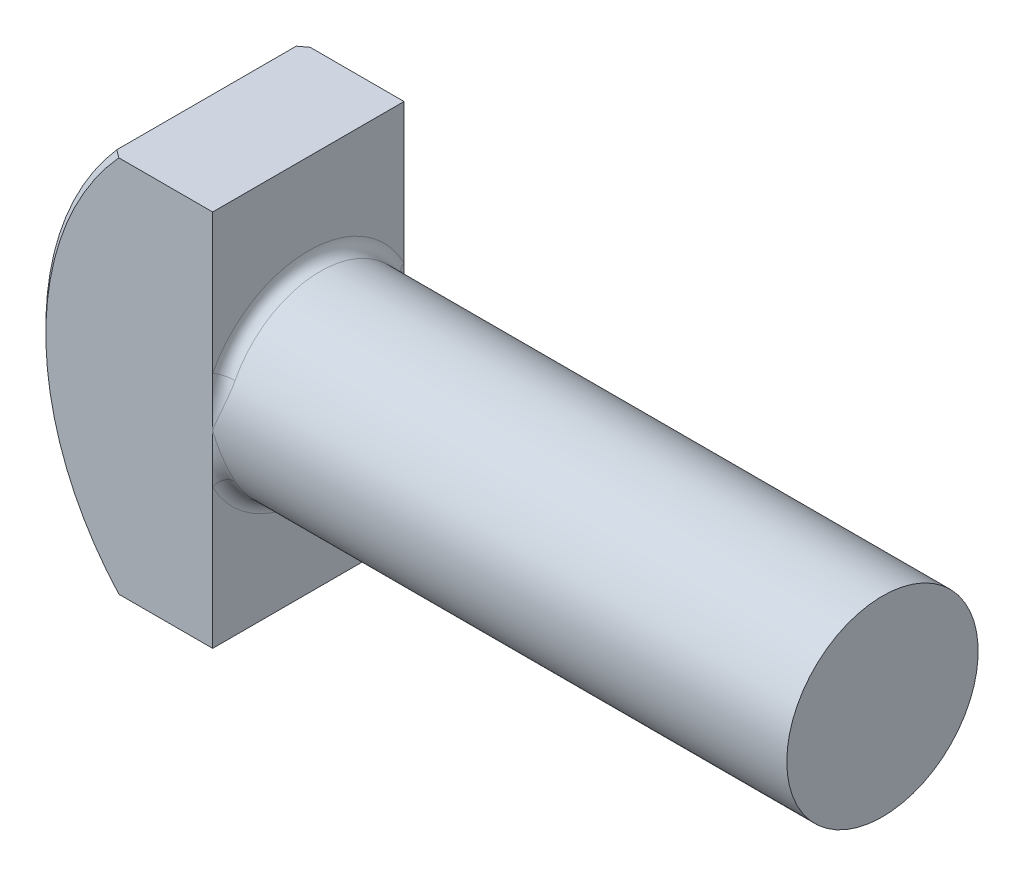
ISO-10303-21;
HEADER;
FILE_DESCRIPTION(('STEP AP214'),'2;1');
FILE_NAME('part.step','',(''),(''),'','','');
FILE_SCHEMA(('AUTOMOTIVE_DESIGN { 1 0 10303 214 1 1 1 1 }'));
ENDSEC;
DATA;
#1=APPLICATION_CONTEXT('core data for automotive mechanical design processes');
#2=APPLICATION_PROTOCOL_DEFINITION('international standard','automotive_design',2000,#1);
#3=PRODUCT_CONTEXT('',#1,'mechanical');
#4=PRODUCT('Part','Part','',(#3));
#5=PRODUCT_RELATED_PRODUCT_CATEGORY('part','',(#4));
#6=PRODUCT_DEFINITION_FORMATION('','',#4);
#7=PRODUCT_DEFINITION_CONTEXT('part definition',#1,'design');
#8=PRODUCT_DEFINITION('design','',#6,#7);
#9=PRODUCT_DEFINITION_SHAPE('','',#8);
#10=(LENGTH_UNIT() NAMED_UNIT(*) SI_UNIT(.MILLI.,.METRE.));
#11=(NAMED_UNIT(*) PLANE_ANGLE_UNIT() SI_UNIT($,.RADIAN.));
#12=(NAMED_UNIT(*) SI_UNIT($,.STERADIAN.) SOLID_ANGLE_UNIT());
#13=UNCERTAINTY_MEASURE_WITH_UNIT(LENGTH_MEASURE(1.E-05),#10,'distance_accuracy_value','');
#14=(GEOMETRIC_REPRESENTATION_CONTEXT(3) GLOBAL_UNCERTAINTY_ASSIGNED_CONTEXT((#13)) GLOBAL_UNIT_ASSIGNED_CONTEXT((#10,
#11,#12)) REPRESENTATION_CONTEXT('',''));
#15=CARTESIAN_POINT('',(0.,0.,0.));
#16=DIRECTION('',(0.,0.,1.));
#17=DIRECTION('',(1.,0.,0.));
#18=AXIS2_PLACEMENT_3D('',#15,#16,#17);
#19=CARTESIAN_POINT('',(22.9362,25.0825,12.7));
#20=DIRECTION('',(1.,0.,0.));
#21=DIRECTION('',(0.,1.,0.));
#22=AXIS2_PLACEMENT_3D('',#19,#20,#21);
#23=PLANE('',#22);
#24=DIRECTION('',(0.,-1.,0.));
#25=VECTOR('',#24,1.);
#26=CARTESIAN_POINT('',(22.9362,25.0825,12.7));
#27=LINE('',#26,#25);
#28=CARTESIAN_POINT('',(22.9362,25.0825,12.7));
#29=VERTEX_POINT('',#28);
#30=CARTESIAN_POINT('',(22.9362,6.51766177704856,12.7));
#31=VERTEX_POINT('',#30);
#32=EDGE_CURVE('E270',#29,#31,#27,.T.);
#33=ORIENTED_EDGE('',*,*,#32,.T.);
#34=CARTESIAN_POINT('',(22.9362,0.,0.));
#35=DIRECTION('',(1.,0.,0.));
#36=DIRECTION('',(0.,1.,0.));
#37=AXIS2_PLACEMENT_3D('',#34,#35,#36);
#38=CIRCLE('',#37,14.2748);
#39=CARTESIAN_POINT('',(22.9362,6.51766177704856,-12.7));
#40=VERTEX_POINT('',#39);
#41=EDGE_CURVE('E11',#31,#40,#38,.F.);
#42=ORIENTED_EDGE('',*,*,#41,.T.);
#43=DIRECTION('',(0.,-1.,0.));
#44=VECTOR('',#43,1.);
#45=CARTESIAN_POINT('',(22.9362,25.0825,-12.7));
#46=LINE('',#45,#44);
#47=CARTESIAN_POINT('',(22.9362,25.0825,-12.7));
#48=VERTEX_POINT('',#47);
#49=EDGE_CURVE('E130',#48,#40,#46,.T.);
#50=ORIENTED_EDGE('',*,*,#49,.F.);
#51=DIRECTION('',(0.,0.,-1.));
#52=VECTOR('',#51,1.);
#53=CARTESIAN_POINT('',(22.9362,25.0825,12.7));
#54=LINE('',#53,#52);
#55=EDGE_CURVE('E272',#29,#48,#54,.T.);
#56=ORIENTED_EDGE('',*,*,#55,.F.);
#57=EDGE_LOOP('',(#33,#42,#50,#56));
#58=FACE_BOUND('',#57,.T.);
#59=ADVANCED_FACE('F35',(#58),#23,.T.);
#60=CARTESIAN_POINT('',(22.9362,-6.51766177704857,-12.7));
#61=VERTEX_POINT('',#60);
#62=CARTESIAN_POINT('',(22.9362,-25.0825,-12.7));
#63=VERTEX_POINT('',#62);
#64=EDGE_CURVE('E136',#61,#63,#46,.T.);
#65=ORIENTED_EDGE('',*,*,#64,.F.);
#66=CARTESIAN_POINT('',(22.9362,0.,0.));
#67=DIRECTION('',(1.,0.,0.));
#68=DIRECTION('',(0.,1.,0.));
#69=AXIS2_PLACEMENT_3D('',#66,#67,#68);
#70=CIRCLE('',#69,14.2748);
#71=CARTESIAN_POINT('',(22.9362,-6.51766177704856,12.7));
#72=VERTEX_POINT('',#71);
#73=EDGE_CURVE('E364',#61,#72,#70,.F.);
#74=ORIENTED_EDGE('',*,*,#73,.T.);
#75=CARTESIAN_POINT('',(22.9362,-25.0825,12.7));
#76=VERTEX_POINT('',#75);
#77=EDGE_CURVE('E282',#72,#76,#27,.T.);
#78=ORIENTED_EDGE('',*,*,#77,.T.);
#79=DIRECTION('',(0.,0.,-1.));
#80=VECTOR('',#79,1.);
#81=CARTESIAN_POINT('',(22.9362,-25.0825,12.7));
#82=LINE('',#81,#80);
#83=EDGE_CURVE('E305',#76,#63,#82,.T.);
#84=ORIENTED_EDGE('',*,*,#83,.T.);
#85=EDGE_LOOP('',(#65,#74,#78,#84));
#86=FACE_BOUND('',#85,.T.);
#87=ADVANCED_FACE('F262',(#86),#23,.T.);
#88=CARTESIAN_POINT('',(9.42111937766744,25.0825,12.7));
#89=DIRECTION('',(0.,1.,0.));
#90=DIRECTION('',(0.,0.,1.));
#91=AXIS2_PLACEMENT_3D('',#88,#89,#90);
#92=PLANE('',#91);
#93=DIRECTION('',(0.,0.,-1.));
#94=VECTOR('',#93,1.);
#95=CARTESIAN_POINT('',(9.42111937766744,25.0825,12.7));
#96=LINE('',#95,#94);
#97=CARTESIAN_POINT('',(9.42111937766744,25.0825,11.90625));
#98=VERTEX_POINT('',#97);
#99=CARTESIAN_POINT('',(9.42111937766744,25.0825,-11.90625));
#100=VERTEX_POINT('',#99);
#101=EDGE_CURVE('E299',#98,#100,#96,.T.);
#102=ORIENTED_EDGE('',*,*,#101,.F.);
#103=CARTESIAN_POINT('',(9.42111937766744,25.0825,11.90625));
#104=CARTESIAN_POINT('',(9.59779319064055,25.0825,12.0392518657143));
#105=CARTESIAN_POINT('',(9.77473210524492,25.0825,12.1718986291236));
#106=CARTESIAN_POINT('',(10.1291401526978,25.0825,12.436481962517));
#107=CARTESIAN_POINT('',(10.3066092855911,25.0825,12.568418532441));
#108=CARTESIAN_POINT('',(10.4843435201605,25.0825,12.7));
#109=B_SPLINE_CURVE_WITH_KNOTS('',3,(#103,#104,#105,#106,#107,#108),.UNSPECIFIED.,.F.,.F.,(4,2,
4),(0.,0.663417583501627,1.32683522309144),.UNSPECIFIED.);
#110=CARTESIAN_POINT('',(10.4843435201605,25.0825,12.7));
#111=VERTEX_POINT('',#110);
#112=EDGE_CURVE('E334',#98,#111,#109,.T.);
#113=ORIENTED_EDGE('',*,*,#112,.T.);
#114=DIRECTION('',(1.,0.,0.));
#115=VECTOR('',#114,1.);
#116=CARTESIAN_POINT('',(9.42111937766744,25.0825,12.7));
#117=LINE('',#116,#115);
#118=EDGE_CURVE('E280',#111,#29,#117,.T.);
#119=ORIENTED_EDGE('',*,*,#118,.T.);
#120=ORIENTED_EDGE('',*,*,#55,.T.);
#121=DIRECTION('',(1.,0.,0.));
#122=VECTOR('',#121,1.);
#123=CARTESIAN_POINT('',(9.42111937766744,25.0825,-12.7));
#124=LINE('',#123,#122);
#125=CARTESIAN_POINT('',(10.4843435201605,25.0825,-12.7));
#126=VERTEX_POINT('',#125);
#127=EDGE_CURVE('E288',#126,#48,#124,.T.);
#128=ORIENTED_EDGE('',*,*,#127,.F.);
#129=CARTESIAN_POINT('',(10.4843435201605,25.0825,-12.7));
#130=CARTESIAN_POINT('',(10.3066092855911,25.0825,-12.568418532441));
#131=CARTESIAN_POINT('',(10.1291401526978,25.0825,-12.436481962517));
#132=CARTESIAN_POINT('',(9.77473210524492,25.0825,-12.1718986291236));
#133=CARTESIAN_POINT('',(9.59779319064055,25.0825,-12.0392518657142));
#134=CARTESIAN_POINT('',(9.42111937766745,25.0825,-11.90625));
#135=B_SPLINE_CURVE_WITH_KNOTS('',3,(#129,#130,#131,#132,#133,#134),.UNSPECIFIED.,.F.,.F.,(4,2,
4),(0.,0.663417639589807,1.32683522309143),.UNSPECIFIED.);
#136=EDGE_CURVE('E328',#126,#100,#135,.T.);
#137=ORIENTED_EDGE('',*,*,#136,.T.);
#138=EDGE_LOOP('',(#102,#113,#119,#120,#128,#137));
#139=FACE_BOUND('',#138,.T.);
#140=ADVANCED_FACE('F266',(#139),#92,.T.);
#141=CARTESIAN_POINT('',(38.1,0.,12.7));
#142=DIRECTION('',(0.,0.,-1.));
#143=DIRECTION('',(-1.,0.,0.));
#144=AXIS2_PLACEMENT_3D('',#141,#142,#143);
#145=CYLINDRICAL_SURFACE('',#144,38.1);
#146=DIRECTION('',(0.,0.,-1.));
#147=VECTOR('',#146,1.);
#148=CARTESIAN_POINT('',(9.42111937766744,-25.0825,12.7));
#149=LINE('',#148,#147);
#150=CARTESIAN_POINT('',(9.42111937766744,-25.0825,11.90625));
#151=VERTEX_POINT('',#150);
#152=CARTESIAN_POINT('',(9.42111937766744,-25.0825,-11.90625));
#153=VERTEX_POINT('',#152);
#154=EDGE_CURVE('E302',#151,#153,#149,.T.);
#155=ORIENTED_EDGE('',*,*,#154,.F.);
#156=CARTESIAN_POINT('',(38.1,0.,11.90625));
#157=DIRECTION('',(0.,0.,1.));
#158=DIRECTION('',(1.,0.,0.));
#159=AXIS2_PLACEMENT_3D('',#156,#157,#158);
#160=CIRCLE('',#159,38.1);
#161=EDGE_CURVE('E335',#151,#98,#160,.F.);
#162=ORIENTED_EDGE('',*,*,#161,.T.);
#163=ORIENTED_EDGE('',*,*,#101,.T.);
#164=CARTESIAN_POINT('',(38.1,0.,-11.90625));
#165=DIRECTION('',(0.,0.,1.));
#166=DIRECTION('',(1.,0.,0.));
#167=AXIS2_PLACEMENT_3D('',#164,#165,#166);
#168=CIRCLE('',#167,38.1);
#169=EDGE_CURVE('E356',#100,#153,#168,.T.);
#170=ORIENTED_EDGE('',*,*,#169,.T.);
#171=EDGE_LOOP('',(#155,#162,#163,#170));
#172=FACE_BOUND('',#171,.T.);
#173=ADVANCED_FACE('F342',(#172),#145,.T.);
#174=CARTESIAN_POINT('',(22.9362,-25.0825,12.7));
#175=DIRECTION('',(0.,-1.,0.));
#176=DIRECTION('',(1.,0.,0.));
#177=AXIS2_PLACEMENT_3D('',#174,#175,#176);
#178=PLANE('',#177);
#179=DIRECTION('',(-1.,0.,0.));
#180=VECTOR('',#179,1.);
#181=CARTESIAN_POINT('',(22.9362,-25.0825,12.7));
#182=LINE('',#181,#180);
#183=CARTESIAN_POINT('',(10.4843435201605,-25.0825,12.7));
#184=VERTEX_POINT('',#183);
#185=EDGE_CURVE('E275',#76,#184,#182,.T.);
#186=ORIENTED_EDGE('',*,*,#185,.T.);
#187=CARTESIAN_POINT('',(10.4843435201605,-25.0825,12.7));
#188=CARTESIAN_POINT('',(10.3066092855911,-25.0825,12.568418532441));
#189=CARTESIAN_POINT('',(10.1291401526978,-25.0825,12.436481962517));
#190=CARTESIAN_POINT('',(9.77473210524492,-25.0825,12.1718986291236));
#191=CARTESIAN_POINT('',(9.59779319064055,-25.0825,12.0392518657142));
#192=CARTESIAN_POINT('',(9.42111937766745,-25.0825,11.90625));
#193=B_SPLINE_CURVE_WITH_KNOTS('',3,(#187,#188,#189,#190,#191,#192),.UNSPECIFIED.,.F.,.F.,(4,2,
4),(0.,0.66341763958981,1.32683522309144),.UNSPECIFIED.);
#194=EDGE_CURVE('E314',#184,#151,#193,.T.);
#195=ORIENTED_EDGE('',*,*,#194,.T.);
#196=ORIENTED_EDGE('',*,*,#154,.T.);
#197=CARTESIAN_POINT('',(9.42111937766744,-25.0825,-11.90625));
#198=CARTESIAN_POINT('',(9.59779319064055,-25.0825,-12.0392518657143));
#199=CARTESIAN_POINT('',(9.77473210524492,-25.0825,-12.1718986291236));
#200=CARTESIAN_POINT('',(10.1291401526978,-25.0825,-12.436481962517));
#201=CARTESIAN_POINT('',(10.3066092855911,-25.0825,-12.568418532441));
#202=CARTESIAN_POINT('',(10.4843435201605,-25.0825,-12.7));
#203=B_SPLINE_CURVE_WITH_KNOTS('',3,(#197,#198,#199,#200,#201,#202),.UNSPECIFIED.,.F.,.F.,(4,2,
4),(0.,0.663417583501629,1.32683522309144),.UNSPECIFIED.);
#204=CARTESIAN_POINT('',(10.4843435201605,-25.0825,-12.7));
#205=VERTEX_POINT('',#204);
#206=EDGE_CURVE('E309',#153,#205,#203,.T.);
#207=ORIENTED_EDGE('',*,*,#206,.T.);
#208=DIRECTION('',(-1.,0.,0.));
#209=VECTOR('',#208,1.);
#210=CARTESIAN_POINT('',(22.9362,-25.0825,-12.7));
#211=LINE('',#210,#209);
#212=EDGE_CURVE('E292',#63,#205,#211,.T.);
#213=ORIENTED_EDGE('',*,*,#212,.F.);
#214=ORIENTED_EDGE('',*,*,#83,.F.);
#215=EDGE_LOOP('',(#186,#195,#196,#207,#213,#214));
#216=FACE_BOUND('',#215,.T.);
#217=ADVANCED_FACE('F216',(#216),#178,.T.);
#218=CARTESIAN_POINT('',(38.1,0.,12.7));
#219=DIRECTION('',(0.,0.,1.));
#220=DIRECTION('',(1.,0.,0.));
#221=AXIS2_PLACEMENT_3D('',#218,#219,#220);
#222=PLANE('',#221);
#223=ORIENTED_EDGE('',*,*,#118,.F.);
#224=CARTESIAN_POINT('',(38.1,0.,12.7));
#225=DIRECTION('',(0.,0.,1.));
#226=DIRECTION('',(1.,0.,0.));
#227=AXIS2_PLACEMENT_3D('',#224,#225,#226);
#228=CIRCLE('',#227,37.30625);
#229=EDGE_CURVE('E298',#111,#184,#228,.T.);
#230=ORIENTED_EDGE('',*,*,#229,.T.);
#231=ORIENTED_EDGE('',*,*,#185,.F.);
#232=ORIENTED_EDGE('',*,*,#77,.F.);
#233=CARTESIAN_POINT('',(22.9362,0.,12.7));
#234=VERTEX_POINT('',#233);
#235=EDGE_CURVE('E278',#234,#72,#27,.T.);
#236=ORIENTED_EDGE('',*,*,#235,.F.);
#237=EDGE_CURVE('E276',#31,#234,#27,.T.);
#238=ORIENTED_EDGE('',*,*,#237,.F.);
#239=ORIENTED_EDGE('',*,*,#32,.F.);
#240=EDGE_LOOP('',(#223,#230,#231,#232,#236,#238,#239));
#241=FACE_BOUND('',#240,.T.);
#242=ADVANCED_FACE('F213',(#241),#222,.T.);
#243=CARTESIAN_POINT('',(38.1,0.,-12.7));
#244=DIRECTION('',(0.,0.,1.));
#245=DIRECTION('',(1.,0.,0.));
#246=AXIS2_PLACEMENT_3D('',#243,#244,#245);
#247=PLANE('',#246);
#248=ORIENTED_EDGE('',*,*,#212,.T.);
#249=CARTESIAN_POINT('',(38.1,0.,-12.7));
#250=DIRECTION('',(0.,0.,1.));
#251=DIRECTION('',(1.,0.,0.));
#252=AXIS2_PLACEMENT_3D('',#249,#250,#251);
#253=CIRCLE('',#252,37.30625);
#254=EDGE_CURVE('E363',#205,#126,#253,.F.);
#255=ORIENTED_EDGE('',*,*,#254,.T.);
#256=ORIENTED_EDGE('',*,*,#127,.T.);
#257=ORIENTED_EDGE('',*,*,#49,.T.);
#258=CARTESIAN_POINT('',(22.9362,0.,-12.7));
#259=VERTEX_POINT('',#258);
#260=EDGE_CURVE('E124',#40,#259,#46,.T.);
#261=ORIENTED_EDGE('',*,*,#260,.T.);
#262=EDGE_CURVE('E129',#259,#61,#46,.T.);
#263=ORIENTED_EDGE('',*,*,#262,.T.);
#264=ORIENTED_EDGE('',*,*,#64,.T.);
#265=EDGE_LOOP('',(#248,#255,#256,#257,#261,#263,#264));
#266=FACE_BOUND('',#265,.T.);
#267=ADVANCED_FACE('F127',(#266),#247,.F.);
#268=CARTESIAN_POINT('',(0.,0.,0.));
#269=DIRECTION('',(-1.,0.,0.));
#270=DIRECTION('',(0.,0.,1.));
#271=AXIS2_PLACEMENT_3D('',#268,#269,#270);
#272=CYLINDRICAL_SURFACE('',#271,12.7);
#273=CARTESIAN_POINT('',(99.1362,0.,0.));
#274=DIRECTION('',(-1.,0.,0.));
#275=DIRECTION('',(0.,0.,1.));
#276=AXIS2_PLACEMENT_3D('',#273,#274,#275);
#277=CIRCLE('',#276,12.7);
#278=CARTESIAN_POINT('',(99.1362,0.,12.7));
#279=VERTEX_POINT('',#278);
#280=EDGE_CURVE('E239',#279,#279,#277,.T.);
#281=ORIENTED_EDGE('',*,*,#280,.T.);
#282=EDGE_LOOP('',(#281));
#283=FACE_BOUND('',#282,.T.);
#284=CARTESIAN_POINT('',(22.9362000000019,7.95752932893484,9.89786476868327));
#285=CARTESIAN_POINT('',(22.9361999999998,7.08851176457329,10.5965238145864));
#286=CARTESIAN_POINT('',(22.936199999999,7.45886696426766,11.6482619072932));
#287=CARTESIAN_POINT('',(22.9361999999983,7.82922216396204,12.7));
#288=CARTESIAN_POINT('',(22.9362,8.94426296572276,12.7));
#289=CARTESIAN_POINT('',(22.9687095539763,7.95753788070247,9.89785664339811));
#290=CARTESIAN_POINT('',(22.9319532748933,7.08848103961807,10.596552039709));
#291=CARTESIAN_POINT('',(22.9197492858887,7.45883760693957,11.648299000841));
#292=CARTESIAN_POINT('',(22.907548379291,7.8291950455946,12.7000428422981));
#293=CARTESIAN_POINT('',(22.9362,8.94427257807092,12.7));
#294=CARTESIAN_POINT('',(23.0012117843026,7.95641566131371,9.89876009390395));
#295=CARTESIAN_POINT('',(22.9277436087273,7.0890481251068,10.5959316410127));
#296=CARTESIAN_POINT('',(22.9033410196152,7.45926212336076,11.647079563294));
#297=CARTESIAN_POINT('',(22.8789469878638,7.8294759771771,12.6982277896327));
#298=CARTESIAN_POINT('',(22.9362,8.9430112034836,12.7));
#299=CARTESIAN_POINT('',(23.065873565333,7.95197580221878,9.90232778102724));
#300=CARTESIAN_POINT('',(22.9201363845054,7.09114474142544,10.5936083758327));
#301=CARTESIAN_POINT('',(22.8715177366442,7.46079713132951,11.6424086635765));
#302=CARTESIAN_POINT('',(22.8229058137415,7.83044892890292,12.6912108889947));
#303=CARTESIAN_POINT('',(22.9362,8.9380208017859,12.7));
#304=CARTESIAN_POINT('',(23.098033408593,7.94866022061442,9.90499036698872));
#305=CARTESIAN_POINT('',(22.916739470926,7.0926724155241,10.5919075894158));
#306=CARTESIAN_POINT('',(22.8561018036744,7.46190697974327,11.6389592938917));
#307=CARTESIAN_POINT('',(22.7954776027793,7.83114013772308,12.6860154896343));
#308=CARTESIAN_POINT('',(22.9362,8.93429408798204,12.7));
#309=CARTESIAN_POINT('',(23.1614285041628,7.93994297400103,9.91197934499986));
#310=CARTESIAN_POINT('',(22.9115102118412,7.09643549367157,10.5876628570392));
#311=CARTESIAN_POINT('',(22.8272809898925,7.46457834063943,11.6301524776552));
#312=CARTESIAN_POINT('',(22.7430651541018,7.83272010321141,12.6726458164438));
#313=CARTESIAN_POINT('',(22.9362,8.92449590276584,12.7));
#314=CARTESIAN_POINT('',(23.1926697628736,7.9345623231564,9.91628897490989));
#315=CARTESIAN_POINT('',(22.9096624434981,7.09866223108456,10.5851291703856));
#316=CARTESIAN_POINT('',(22.8138576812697,7.46613526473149,11.6248142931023));
#317=CARTESIAN_POINT('',(22.7180690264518,7.83360629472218,12.6645073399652));
#318=CARTESIAN_POINT('',(22.9362,8.91844805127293,12.7));
#319=CARTESIAN_POINT('',(23.2543088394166,7.9218303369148,9.92646314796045));
#320=CARTESIAN_POINT('',(22.9079356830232,7.10344672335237,10.579566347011));
#321=CARTESIAN_POINT('',(22.7894264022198,7.46934989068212,11.6126832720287));
#322=CARTESIAN_POINT('',(22.6709336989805,7.83525076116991,12.6458085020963));
#323=CARTESIAN_POINT('',(22.9362,8.90413729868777,12.7));
#324=CARTESIAN_POINT('',(23.2847065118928,7.9144786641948,9.93232795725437));
#325=CARTESIAN_POINT('',(22.9080547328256,7.10600316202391,10.5765388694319));
#326=CARTESIAN_POINT('',(22.7784188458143,7.47100760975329,11.6058901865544));
#327=CARTESIAN_POINT('',(22.6488003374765,7.83600886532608,12.6352545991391));
#328=CARTESIAN_POINT('',(22.9362,8.8958740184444,12.7));
#329=CARTESIAN_POINT('',(23.3740988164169,7.88972612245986,9.95201820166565));
#330=CARTESIAN_POINT('',(22.9117887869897,7.11351109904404,10.5673268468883));
#331=CARTESIAN_POINT('',(22.7496821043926,7.47553087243,11.584149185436));
#332=CARTESIAN_POINT('',(22.58763799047,7.8375417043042,12.6010189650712));
#333=CARTESIAN_POINT('',(22.9362,8.86805216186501,12.7));
#334=CARTESIAN_POINT('',(23.431576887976,7.86958689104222,9.96797253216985));
#335=CARTESIAN_POINT('',(22.9187316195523,7.11833367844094,10.5609790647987));
#336=CARTESIAN_POINT('',(22.736103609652,7.47796514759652,11.5677917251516));
#337=CARTESIAN_POINT('',(22.5535083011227,7.83759495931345,12.5746777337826));
#338=CARTESIAN_POINT('',(22.9362,8.84541566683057,12.7));
#339=CARTESIAN_POINT('',(23.5414530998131,7.82320138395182,10.0044183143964));
#340=CARTESIAN_POINT('',(22.9412345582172,7.12468157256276,10.5505455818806));
#341=CARTESIAN_POINT('',(22.7201033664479,7.47899699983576,11.5350430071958));
#342=CARTESIAN_POINT('',(22.4990113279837,7.83330945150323,12.5196141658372));
#343=CARTESIAN_POINT('',(22.9362,8.7932783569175,12.7));
#344=CARTESIAN_POINT('',(23.5938375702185,7.79693928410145,10.0249215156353));
#345=CARTESIAN_POINT('',(22.9567685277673,7.12621026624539,10.5464602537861));
#346=CARTESIAN_POINT('',(22.7177108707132,7.47758453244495,11.5186517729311));
#347=CARTESIAN_POINT('',(22.4786423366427,7.82898082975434,12.4909206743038));
#348=CARTESIAN_POINT('',(22.9362,8.76375975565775,12.7));
#349=CARTESIAN_POINT('',(23.6795900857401,7.74734239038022,10.0632691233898));
#350=CARTESIAN_POINT('',(22.9891233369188,7.12451522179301,10.5426937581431));
#351=CARTESIAN_POINT('',(22.7213256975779,7.47055019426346,11.4924351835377));
#352=CARTESIAN_POINT('',(22.453522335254,7.81659567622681,12.442219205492));
#353=CARTESIAN_POINT('',(22.9362,8.70801284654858,12.7));
#354=CARTESIAN_POINT('',(23.7142604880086,7.72514773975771,10.0803247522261));
#355=CARTESIAN_POINT('',(23.0044145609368,7.12248165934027,10.5421116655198));
#356=CARTESIAN_POINT('',(22.7252294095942,7.46617488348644,11.4820352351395));
#357=CARTESIAN_POINT('',(22.4460217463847,7.80989122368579,12.4219968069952));
#358=CARTESIAN_POINT('',(22.9362,8.6830660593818,12.7));
#359=CARTESIAN_POINT('',(23.7807049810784,7.6785622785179,10.1158560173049));
#360=CARTESIAN_POINT('',(23.0374008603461,7.11551228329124,10.54317400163));
#361=CARTESIAN_POINT('',(22.7367766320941,7.45442544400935,11.4630016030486));
#362=CARTESIAN_POINT('',(22.4361289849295,7.79336222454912,12.3828669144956));
#363=CARTESIAN_POINT('',(22.9362,8.63070400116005,12.7));
#364=CARTESIAN_POINT('',(23.8124778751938,7.65417056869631,10.1343322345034));
#365=CARTESIAN_POINT('',(23.0550845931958,7.11058737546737,10.5448104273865));
#366=CARTESIAN_POINT('',(22.7444216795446,7.44705008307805,11.4543686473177));
#367=CARTESIAN_POINT('',(22.4337194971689,7.78355016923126,12.3639580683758));
#368=CARTESIAN_POINT('',(22.9362,8.60328771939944,12.7));
#369=CARTESIAN_POINT('',(23.9036436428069,7.57816312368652,10.1914393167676));
#370=CARTESIAN_POINT('',(23.110312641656,7.09137219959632,10.553116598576));
#371=CARTESIAN_POINT('',(22.7714962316,7.42037354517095,11.4315023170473));
#372=CARTESIAN_POINT('',(22.4325374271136,7.74951780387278,12.3100122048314));
#373=CARTESIAN_POINT('',(22.9362,8.51785535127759,12.7));
#374=CARTESIAN_POINT('',(23.9588225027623,7.52375175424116,10.2317200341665));
#375=CARTESIAN_POINT('',(23.1501869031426,7.07264003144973,10.5631630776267));
#376=CARTESIAN_POINT('',(22.7950591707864,7.39652673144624,11.4203213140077));
#377=CARTESIAN_POINT('',(22.4397222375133,7.72065274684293,12.2775372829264));
#378=CARTESIAN_POINT('',(22.9362,8.45669697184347,12.7));
#379=CARTESIAN_POINT('',(24.0483727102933,7.4217742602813,10.3058421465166));
#380=CARTESIAN_POINT('',(23.2221768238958,7.02947730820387,10.5881796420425));
#381=CARTESIAN_POINT('',(22.8415729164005,7.3443580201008,11.4074961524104));
#382=CARTESIAN_POINT('',(22.4608323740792,7.65938831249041,12.2268502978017));
#383=CARTESIAN_POINT('',(22.9362,8.3420742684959,12.7));
#384=CARTESIAN_POINT('',(24.0846777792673,7.37518653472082,10.3392487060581));
#385=CARTESIAN_POINT('',(23.2541037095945,7.00716063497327,10.6016112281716));
#386=CARTESIAN_POINT('',(22.8636036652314,7.31804231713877,11.4043374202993));
#387=CARTESIAN_POINT('',(22.4729596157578,7.62910907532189,12.2070700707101));
#388=CARTESIAN_POINT('',(22.9362,8.28970966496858,12.7));
#389=CARTESIAN_POINT('',(24.1516241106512,7.27941940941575,10.4068961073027));
#390=CARTESIAN_POINT('',(23.3169092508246,6.95673834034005,10.6324484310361));
#391=CARTESIAN_POINT('',(22.9088387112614,7.25972452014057,11.4023707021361));
#392=CARTESIAN_POINT('',(22.5006260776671,7.56289446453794,12.172298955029));
#393=CARTESIAN_POINT('',(22.9362,8.18206741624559,12.7));
#394=CARTESIAN_POINT('',(24.1822620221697,7.23023849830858,10.4411374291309));
#395=CARTESIAN_POINT('',(23.3477985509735,6.9286619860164,10.6498336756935));
#396=CARTESIAN_POINT('',(22.9320436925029,7.22771908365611,11.4035652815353));
#397=CARTESIAN_POINT('',(22.5161478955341,7.52698642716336,12.1572781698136));
#398=CARTESIAN_POINT('',(22.9362,8.12678807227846,12.7));
#399=CARTESIAN_POINT('',(24.2384690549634,7.12979735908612,10.5099811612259));
#400=CARTESIAN_POINT('',(23.407609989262,6.86755493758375,10.6877422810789));
#401=CARTESIAN_POINT('',(22.9783697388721,7.15887863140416,11.4096389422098));
#402=CARTESIAN_POINT('',(22.5489878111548,7.45041205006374,12.131517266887));
#403=CARTESIAN_POINT('',(22.9362,8.0138922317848,12.7));
#404=CARTESIAN_POINT('',(24.2640316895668,7.07853456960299,10.5445839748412));
#405=CARTESIAN_POINT('',(23.4365479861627,6.83454152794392,10.7082546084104));
#406=CARTESIAN_POINT('',(23.001490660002,7.12203753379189,11.4145227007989));
#407=CARTESIAN_POINT('',(22.5663007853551,7.40976039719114,12.1207538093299));
#408=CARTESIAN_POINT('',(22.9362,7.95627285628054,12.7));
#409=CARTESIAN_POINT('',(24.3105931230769,6.974369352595,10.6137687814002));
#410=CARTESIAN_POINT('',(23.4919350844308,6.76434838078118,10.7516534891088));
#411=CARTESIAN_POINT('',(23.0468482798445,7.0443225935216,11.4273166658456));
#412=CARTESIAN_POINT('',(22.6016292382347,7.32452362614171,12.1029421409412));
#413=CARTESIAN_POINT('',(22.9362,7.83919115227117,12.7));
#414=CARTESIAN_POINT('',(24.3315902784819,6.92146634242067,10.6483507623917));
#415=CARTESIAN_POINT('',(23.5184041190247,6.72718327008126,10.7745320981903));
#416=CARTESIAN_POINT('',(23.0690846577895,7.00344730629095,11.4352279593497));
#417=CARTESIAN_POINT('',(22.6196449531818,7.27995013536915,12.0958716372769));
#418=CARTESIAN_POINT('',(22.9362,7.7797281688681,12.7));
#419=CARTESIAN_POINT('',(24.3840132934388,6.773324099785,10.7435885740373));
#420=CARTESIAN_POINT('',(23.587667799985,6.61977736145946,10.8400638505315));
#421=CARTESIAN_POINT('',(23.1286677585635,6.8857414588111,11.4604666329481));
#422=CARTESIAN_POINT('',(22.6692965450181,7.15243660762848,12.0807143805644));
#423=CARTESIAN_POINT('',(22.9362,7.61321628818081,12.7));
#424=CARTESIAN_POINT('',(24.4111205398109,6.67667296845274,10.8039421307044));
#425=CARTESIAN_POINT('',(23.6278014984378,6.54563315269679,10.8846784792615));
#426=CARTESIAN_POINT('',(23.1645531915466,6.80533678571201,11.4803663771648));
#427=CARTESIAN_POINT('',(22.7010087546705,7.06579502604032,12.0758551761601));
#428=CARTESIAN_POINT('',(22.9362,7.50458041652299,12.7));
#429=CARTESIAN_POINT('',(24.4548191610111,6.4803901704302,10.922808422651));
#430=CARTESIAN_POINT('',(23.6993250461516,6.38916442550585,10.9766816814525));
#431=CARTESIAN_POINT('',(23.2308139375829,6.63674285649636,11.5251219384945));
#432=CARTESIAN_POINT('',(22.7620058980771,6.88507567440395,12.0733607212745));
#433=CARTESIAN_POINT('',(22.9362,7.28395855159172,12.7));
#434=CARTESIAN_POINT('',(24.4714024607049,6.38075627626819,10.9813197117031));
#435=CARTESIAN_POINT('',(23.7308123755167,6.30684838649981,11.0240818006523));
#436=CARTESIAN_POINT('',(23.261185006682,6.54854768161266,11.5499815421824));
#437=CARTESIAN_POINT('',(22.7913331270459,6.79099136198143,12.0756658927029));
#438=CARTESIAN_POINT('',(22.9362,7.17197005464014,12.7));
#439=CARTESIAN_POINT('',(24.4957788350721,6.17914550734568,11.096018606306));
#440=CARTESIAN_POINT('',(23.7856212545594,6.13588840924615,11.1199180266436));
#441=CARTESIAN_POINT('',(23.3162420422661,6.366154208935,11.6027971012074));
#442=CARTESIAN_POINT('',(22.8466391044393,6.5971605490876,12.085461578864));
#443=CARTESIAN_POINT('',(22.9362,6.94535955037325,12.7));
#444=CARTESIAN_POINT('',(24.5035584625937,6.0771652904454,11.1522025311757));
#445=CARTESIAN_POINT('',(23.8090157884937,6.04722588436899,11.1683810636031));
#446=CARTESIAN_POINT('',(23.3409192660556,6.27194695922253,11.6307577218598));
#447=CARTESIAN_POINT('',(22.8726593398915,6.497383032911,12.0929214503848));
#448=CARTESIAN_POINT('',(22.9362,6.83073378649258,12.7));
#449=CARTESIAN_POINT('',(24.5116571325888,5.87150414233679,11.2618399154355));
#450=CARTESIAN_POINT('',(23.8483380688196,5.86506392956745,11.265056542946));
#451=CARTESIAN_POINT('',(23.3847319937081,6.07897545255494,11.6883768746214));
#452=CARTESIAN_POINT('',(22.9209652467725,6.29359932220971,12.1114839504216));
#453=CARTESIAN_POINT('',(22.9362,6.59957065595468,12.7));
#454=CARTESIAN_POINT('',(24.5119735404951,5.76782262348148,11.315292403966));
#455=CARTESIAN_POINT('',(23.8643305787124,5.77154029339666,11.3133015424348));
#456=CARTESIAN_POINT('',(23.4038655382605,5.98020959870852,11.7180360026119));
#457=CARTESIAN_POINT('',(22.9432924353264,6.18955777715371,12.1225670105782));
#458=CARTESIAN_POINT('',(22.9362,6.48303262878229,12.7));
#459=CARTESIAN_POINT('',(24.5038022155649,5.4684815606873,11.4644282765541));
#460=CARTESIAN_POINT('',(23.9005272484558,5.49859584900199,11.449681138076));
#461=CARTESIAN_POINT('',(23.4513365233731,5.69177527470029,11.8040622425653));
#462=CARTESIAN_POINT('',(23.0017539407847,5.88729438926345,12.1577473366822));
#463=CARTESIAN_POINT('',(22.9362,6.14657327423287,12.7));
#464=CARTESIAN_POINT('',(24.4874281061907,5.27115767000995,11.5564632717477));
#465=CARTESIAN_POINT('',(23.9127741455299,5.31349043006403,11.5369799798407));
#466=CARTESIAN_POINT('',(23.4732318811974,5.49766755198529,11.8612500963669));
#467=CARTESIAN_POINT('',(23.0335354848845,5.68392232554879,12.1849344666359));
#468=CARTESIAN_POINT('',(22.9362,5.92478122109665,12.7));
#469=CARTESIAN_POINT('',(24.4380620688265,4.87340684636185,11.7297517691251));
#470=CARTESIAN_POINT('',(23.9186192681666,4.93457382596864,11.704134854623));
#471=CARTESIAN_POINT('',(23.5018768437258,5.10123203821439,11.9736024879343));
#472=CARTESIAN_POINT('',(23.0849889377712,5.26995860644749,12.2424808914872));
#473=CARTESIAN_POINT('',(22.9362,5.47770929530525,12.7));
#474=CARTESIAN_POINT('',(24.4050560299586,4.67297741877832,11.8109960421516));
#475=CARTESIAN_POINT('',(23.9124001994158,4.74051199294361,11.7842088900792));
#476=CARTESIAN_POINT('',(23.5086135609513,4.89889740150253,12.0287652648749));
#477=CARTESIAN_POINT('',(23.1048214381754,5.05907130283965,12.2728606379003));
#478=CARTESIAN_POINT('',(22.9362,5.25242661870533,12.7));
#479=CARTESIAN_POINT('',(24.3262274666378,4.26965133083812,11.9627161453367));
#480=CARTESIAN_POINT('',(23.8852579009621,4.34607663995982,11.9353399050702));
#481=CARTESIAN_POINT('',(23.5097241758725,4.48821055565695,12.1346924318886));
#482=CARTESIAN_POINT('',(23.1341862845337,4.63212296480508,12.3335859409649));
#483=CARTESIAN_POINT('',(22.9362,4.79908809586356,12.7));
#484=CARTESIAN_POINT('',(24.2803812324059,4.06675077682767,12.0331716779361));
#485=CARTESIAN_POINT('',(23.8644132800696,4.14543855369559,12.0065758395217));
#486=CARTESIAN_POINT('',(23.5040750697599,4.27984785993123,12.1854484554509));
#487=CARTESIAN_POINT('',(23.1438113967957,4.41576430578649,12.3639790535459));
#488=CARTESIAN_POINT('',(22.9362,4.57102787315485,12.7));
#489=CARTESIAN_POINT('',(24.1788602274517,3.65952453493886,12.1632055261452));
#490=CARTESIAN_POINT('',(23.8112160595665,3.74003488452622,12.1389564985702));
#491=CARTESIAN_POINT('',(23.4828153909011,3.8591882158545,12.2809290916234));
#492=CARTESIAN_POINT('',(23.1544919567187,3.97983771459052,12.4225620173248));
#493=CARTESIAN_POINT('',(22.9362,4.11330557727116,12.7));
#494=CARTESIAN_POINT('',(24.1231879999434,3.45519922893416,12.2227866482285));
#495=CARTESIAN_POINT('',(23.7789117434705,3.53502333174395,12.2002655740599));
#496=CARTESIAN_POINT('',(23.4672073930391,3.64689229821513,12.325655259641));
#497=CARTESIAN_POINT('',(23.1556176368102,3.75999626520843,12.4508079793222));
#498=CARTESIAN_POINT('',(22.9362,3.88364393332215,12.7));
#499=CARTESIAN_POINT('',(23.9862150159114,2.98309510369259,12.3477755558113));
#500=CARTESIAN_POINT('',(23.6943045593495,3.05958144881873,12.329324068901));
#501=CARTESIAN_POINT('',(23.422199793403,3.15435617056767,12.4207274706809));
#502=CARTESIAN_POINT('',(23.1502836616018,3.25121987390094,12.5117258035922));
#503=CARTESIAN_POINT('',(22.9362,3.35299889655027,12.7));
#504=CARTESIAN_POINT('',(23.9022710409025,2.71493038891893,12.4094378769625));
#505=CARTESIAN_POINT('',(23.638819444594,2.78721790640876,12.3937545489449));
#506=CARTESIAN_POINT('',(23.3900484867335,2.87310160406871,12.4686410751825));
#507=CARTESIAN_POINT('',(23.1414754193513,2.96052590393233,12.5433017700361));
#508=CARTESIAN_POINT('',(22.9362,3.05158175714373,12.7));
#509=CARTESIAN_POINT('',(23.725585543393,2.17734313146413,12.5149610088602));
#510=CARTESIAN_POINT('',(23.5174491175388,2.23941084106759,12.5042643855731));
#511=CARTESIAN_POINT('',(23.3163626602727,2.30738532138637,12.5514672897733));
#512=CARTESIAN_POINT('',(23.115478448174,2.37689131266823,12.5984462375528));
#513=CARTESIAN_POINT('',(22.9362,2.44733367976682,12.7));
#514=CARTESIAN_POINT('',(23.6328408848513,1.90792017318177,12.5588154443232));
#515=CARTESIAN_POINT('',(23.4514996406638,1.96345577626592,12.550542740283));
#516=CARTESIAN_POINT('',(23.2748247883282,2.02292249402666,12.5863752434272));
#517=CARTESIAN_POINT('',(23.0983070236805,2.08340046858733,12.6221082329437));
#518=CARTESIAN_POINT('',(22.9362,2.14450227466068,12.7));
#519=CARTESIAN_POINT('',(23.4420323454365,1.36892835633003,12.6289249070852));
#520=CARTESIAN_POINT('',(23.3132496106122,1.41049153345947,12.6245616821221));
#521=CARTESIAN_POINT('',(23.1858581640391,1.45271345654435,12.6424903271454));
#522=CARTESIAN_POINT('',(23.0586237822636,1.4959376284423,12.6603203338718));
#523=CARTESIAN_POINT('',(22.9362,1.53867547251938,12.7));
#524=CARTESIAN_POINT('',(23.3439799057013,1.0993609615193,12.6552162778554));
#525=CARTESIAN_POINT('',(23.2408620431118,1.13299844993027,12.652471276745));
#526=CARTESIAN_POINT('',(23.1384418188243,1.16697113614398,12.6637257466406));
#527=CARTESIAN_POINT('',(23.0361066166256,1.20144797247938,12.6749551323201));
#528=CARTESIAN_POINT('',(22.9362,1.23568172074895,12.7));
#529=CARTESIAN_POINT('',(23.1451971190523,0.559899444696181,12.6905300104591));
#530=CARTESIAN_POINT('',(23.0929987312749,0.577491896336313,12.6899202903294));
#531=CARTESIAN_POINT('',(23.040679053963,0.59460711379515,12.6922987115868));
#532=CARTESIAN_POINT('',(22.9884460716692,0.612223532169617,12.6946520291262));
#533=CARTESIAN_POINT('',(22.9362,0.629326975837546,12.7));
#534=CARTESIAN_POINT('',(23.0444672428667,0.290005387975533,12.6995553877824));
#535=CARTESIAN_POINT('',(23.0174016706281,0.299001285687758,12.6995273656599));
#536=CARTESIAN_POINT('',(22.9903331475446,0.307985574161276,12.6996386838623));
#537=CARTESIAN_POINT('',(22.9632667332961,0.316982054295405,12.6997495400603));
#538=CARTESIAN_POINT('',(22.9362,0.325966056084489,12.7));
#539=CARTESIAN_POINT('',(22.9412214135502,0.0134503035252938,12.6999946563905));
#540=CARTESIAN_POINT('',(22.9399660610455,0.0138672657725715,12.6999943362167));
#541=CARTESIAN_POINT('',(22.9387107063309,0.014284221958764,12.6999956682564));
#542=CARTESIAN_POINT('',(22.9374553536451,0.0147011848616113,12.6999970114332));
#543=CARTESIAN_POINT('',(22.9362,0.0151181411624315,12.7));
#544=CARTESIAN_POINT('',(22.9387106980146,0.0067251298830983,12.6999999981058));
#545=CARTESIAN_POINT('',(22.9380830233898,0.00693360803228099,12.7000000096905));
#546=CARTESIAN_POINT('',(22.9374553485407,0.00714208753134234,12.7000000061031));
#547=CARTESIAN_POINT('',(22.9368276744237,0.00735056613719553,12.7000000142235));
#548=CARTESIAN_POINT('',(22.9362,0.00755904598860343,12.7));
#549=CARTESIAN_POINT('',(22.9362,0.,12.7));
#550=CARTESIAN_POINT('',(22.9362,0.,12.7));
#551=CARTESIAN_POINT('',(22.9362,0.,12.7));
#552=CARTESIAN_POINT('',(22.9362,0.,12.7));
#553=CARTESIAN_POINT('',(22.9362,0.,12.7));
#554=(BOUNDED_SURFACE() B_SPLINE_SURFACE(3,2,((#284,#285,#286,#287,#288),(#289,#290,#291,#292,
#293),(#294,#295,#296,#297,#298),(#299,#300,#301,#302,#303),(#304,#305,#306,#307,#308),(#309,
#310,#311,#312,#313),(#314,#315,#316,#317,#318),(#319,#320,#321,#322,#323),(#324,#325,#326,#327,
#328),(#329,#330,#331,#332,#333),(#334,#335,#336,#337,#338),(#339,#340,#341,#342,#343),(#344,
#345,#346,#347,#348),(#349,#350,#351,#352,#353),(#354,#355,#356,#357,#358),(#359,#360,#361,#362,
#363),(#364,#365,#366,#367,#368),(#369,#370,#371,#372,#373),(#374,#375,#376,#377,#378),(#379,
#380,#381,#382,#383),(#384,#385,#386,#387,#388),(#389,#390,#391,#392,#393),(#394,#395,#396,#397,
#398),(#399,#400,#401,#402,#403),(#404,#405,#406,#407,#408),(#409,#410,#411,#412,#413),(#414,
#415,#416,#417,#418),(#419,#420,#421,#422,#423),(#424,#425,#426,#427,#428),(#429,#430,#431,#432,
#433),(#434,#435,#436,#437,#438),(#439,#440,#441,#442,#443),(#444,#445,#446,#447,#448),(#449,
#450,#451,#452,#453),(#454,#455,#456,#457,#458),(#459,#460,#461,#462,#463),(#464,#465,#466,#467,
#468),(#469,#470,#471,#472,#473),(#474,#475,#476,#477,#478),(#479,#480,#481,#482,#483),(#484,
#485,#486,#487,#488),(#489,#490,#491,#492,#493),(#494,#495,#496,#497,#498),(#499,#500,#501,#502,
#503),(#504,#505,#506,#507,#508),(#509,#510,#511,#512,#513),(#514,#515,#516,#517,#518),(#519,
#520,#521,#522,#523),(#524,#525,#526,#527,#528),(#529,#530,#531,#532,#533),(#534,#535,#536,#537,
#538),(#539,#540,#541,#542,#543),(#544,#545,#546,#547,#548),(#549,#550,#551,#552,#553)),
.UNSPECIFIED.,.F.,.F.,.F.) B_SPLINE_SURFACE_WITH_KNOTS((4,2,2,2,2,2,2,2,2,2,2,2,2,2,2,2,2,2,2,2,
2,2,2,2,2,2,4),(3,2,3),(0.,0.0974765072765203,0.194861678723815,0.291281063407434,
0.387716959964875,0.579730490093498,0.772245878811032,0.912509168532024,1.05283012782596,
1.33371033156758,1.55531963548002,1.77705955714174,1.99908108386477,2.22118240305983,
2.61327832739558,3.00567474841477,3.39866972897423,3.79180343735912,4.52642909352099,
5.26167907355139,5.99829576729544,6.73472208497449,7.6952767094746,8.65617491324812,
9.61507850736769,10.5738146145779,10.5977100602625),(0.,0.5,1.),
.UNSPECIFIED.) GEOMETRIC_REPRESENTATION_ITEM() RATIONAL_B_SPLINE_SURFACE(((1.,0.816132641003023,
1.,0.816132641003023,1.),(1.,0.816131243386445,1.,0.816131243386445,1.),(1.,0.816231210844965,
1.,0.816231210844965,1.),(1.,0.816623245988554,1.,0.816623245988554,1.),(1.,0.816915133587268,
1.,0.816915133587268,1.),(1.,0.817676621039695,1.,0.817676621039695,1.),(1.,0.818144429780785,
1.,0.818144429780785,1.),(1.,0.819239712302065,1.,0.819239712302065,1.),(1.,0.819867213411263,
1.,0.819867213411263,1.),(1.,0.821952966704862,1.,0.821952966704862,1.),(1.,0.823618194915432,
1.,0.823618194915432,1.),(1.,0.827325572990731,1.,0.827325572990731,1.),(1.,0.829368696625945,
1.,0.829368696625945,1.),(1.,0.833090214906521,1.,0.833090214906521,1.),(1.,0.834717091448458,
1.,0.834717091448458,1.),(1.,0.838044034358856,1.,0.838044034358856,1.),(1.,0.839744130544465,
1.,0.839744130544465,1.),(1.,0.844903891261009,1.,0.844903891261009,1.),(1.,0.848420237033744,
1.,0.848420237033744,1.),(1.,0.854679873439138,1.,0.854679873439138,1.),(1.,0.857429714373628,
1.,0.857429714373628,1.),(1.,0.86286981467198,1.,0.86286981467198,1.),(1.,0.865560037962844,1.,
0.865560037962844,1.),(1.,0.870856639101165,1.,0.870856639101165,1.),(1.,0.873462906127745,1.,
0.873462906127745,1.),(1.,0.87857685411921,1.,0.87857685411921,1.),(1.,0.881084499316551,1.,
0.881084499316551,1.),(1.,0.887875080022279,1.,0.887875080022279,1.),(1.,0.892047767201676,1.,
0.892047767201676,1.),(1.,0.900067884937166,1.,0.900067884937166,1.),(1.,0.903915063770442,1.,
0.903915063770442,1.),(1.,0.91130413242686,1.,0.91130413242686,1.),(1.,0.914845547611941,1.,
0.914845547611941,1.),(1.,0.921637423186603,1.,0.921637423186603,1.),(1.,0.924887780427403,1.,
0.924887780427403,1.),(1.,0.933824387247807,1.,0.933824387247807,1.),(1.,0.939174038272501,1.,
0.939174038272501,1.),(1.,0.949047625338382,1.,0.949047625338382,1.),(1.,0.953570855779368,1.,
0.953570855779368,1.),(1.,0.96188903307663,1.,0.96188903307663,1.),(1.,0.965682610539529,1.,
0.965682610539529,1.),(1.,0.972601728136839,1.,0.972601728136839,1.),(1.,0.975727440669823,1.,
0.975727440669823,1.),(1.,0.982226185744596,1.,0.982226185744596,1.),(1.,0.985384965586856,1.,
0.985384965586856,1.),(1.,0.990750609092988,1.,0.990750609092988,1.),(1.,0.992957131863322,1.,
0.992957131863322,1.),(1.,0.99646960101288,1.,0.99646960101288,1.),(1.,0.997777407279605,1.,
0.997777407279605,1.),(1.,0.99953152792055,1.,0.99953152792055,1.),(1.,0.999977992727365,1.,
0.999977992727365,1.),(1.,0.999999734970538,1.,0.999999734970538,1.),(1.,0.999999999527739,1.,
0.999999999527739,1.),(1.,1.,1.,1.,1.))) REPRESENTATION_ITEM('') SURFACE());
#555=CARTESIAN_POINT('',(22.9362000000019,7.95752932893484,9.89786476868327));
#556=CARTESIAN_POINT('',(22.9687095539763,7.95753788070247,9.89785664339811));
#557=CARTESIAN_POINT('',(23.0012117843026,7.95641566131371,9.89876009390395));
#558=CARTESIAN_POINT('',(23.065873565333,7.95197580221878,9.90232778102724));
#559=CARTESIAN_POINT('',(23.098033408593,7.94866022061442,9.90499036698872));
#560=CARTESIAN_POINT('',(23.1614285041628,7.93994297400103,9.91197934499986));
#561=CARTESIAN_POINT('',(23.1926697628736,7.9345623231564,9.91628897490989));
#562=CARTESIAN_POINT('',(23.2543088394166,7.9218303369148,9.92646314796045));
#563=CARTESIAN_POINT('',(23.2847065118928,7.9144786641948,9.93232795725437));
#564=CARTESIAN_POINT('',(23.3740988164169,7.88972612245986,9.95201820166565));
#565=CARTESIAN_POINT('',(23.431576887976,7.86958689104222,9.96797253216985));
#566=CARTESIAN_POINT('',(23.5414530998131,7.82320138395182,10.0044183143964));
#567=CARTESIAN_POINT('',(23.5938375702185,7.79693928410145,10.0249215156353));
#568=CARTESIAN_POINT('',(23.6795900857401,7.74734239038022,10.0632691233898));
#569=CARTESIAN_POINT('',(23.7142604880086,7.72514773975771,10.0803247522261));
#570=CARTESIAN_POINT('',(23.7807049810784,7.6785622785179,10.1158560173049));
#571=CARTESIAN_POINT('',(23.8124778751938,7.65417056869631,10.1343322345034));
#572=CARTESIAN_POINT('',(23.9036436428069,7.57816312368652,10.1914393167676));
#573=CARTESIAN_POINT('',(23.9588225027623,7.52375175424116,10.2317200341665));
#574=CARTESIAN_POINT('',(24.0483727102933,7.4217742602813,10.3058421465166));
#575=CARTESIAN_POINT('',(24.0846777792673,7.37518653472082,10.3392487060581));
#576=CARTESIAN_POINT('',(24.1516241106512,7.27941940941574,10.4068961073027));
#577=CARTESIAN_POINT('',(24.1822620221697,7.23023849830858,10.4411374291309));
#578=CARTESIAN_POINT('',(24.2384690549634,7.12979735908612,10.5099811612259));
#579=CARTESIAN_POINT('',(24.2640316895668,7.07853456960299,10.5445839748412));
#580=CARTESIAN_POINT('',(24.3105931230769,6.974369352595,10.6137687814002));
#581=CARTESIAN_POINT('',(24.3315902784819,6.92146634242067,10.6483507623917));
#582=CARTESIAN_POINT('',(24.3840132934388,6.773324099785,10.7435885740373));
#583=CARTESIAN_POINT('',(24.4111205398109,6.67667296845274,10.8039421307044));
#584=CARTESIAN_POINT('',(24.4548191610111,6.4803901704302,10.922808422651));
#585=CARTESIAN_POINT('',(24.4714024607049,6.38075627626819,10.9813197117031));
#586=CARTESIAN_POINT('',(24.4957788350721,6.17914550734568,11.096018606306));
#587=CARTESIAN_POINT('',(24.5035584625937,6.0771652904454,11.1522025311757));
#588=CARTESIAN_POINT('',(24.5116571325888,5.87150414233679,11.2618399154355));
#589=CARTESIAN_POINT('',(24.5119735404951,5.76782262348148,11.315292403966));
#590=CARTESIAN_POINT('',(24.5038022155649,5.4684815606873,11.4644282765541));
#591=CARTESIAN_POINT('',(24.4874281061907,5.27115767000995,11.5564632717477));
#592=CARTESIAN_POINT('',(24.4380620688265,4.87340684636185,11.7297517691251));
#593=CARTESIAN_POINT('',(24.4050560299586,4.67297741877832,11.8109960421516));
#594=CARTESIAN_POINT('',(24.3262274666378,4.26965133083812,11.9627161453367));
#595=CARTESIAN_POINT('',(24.2803812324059,4.06675077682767,12.0331716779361));
#596=CARTESIAN_POINT('',(24.1788602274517,3.65952453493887,12.1632055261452));
#597=CARTESIAN_POINT('',(24.1231879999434,3.45519922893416,12.2227866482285));
#598=CARTESIAN_POINT('',(23.9862150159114,2.98309510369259,12.3477755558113));
#599=CARTESIAN_POINT('',(23.9022710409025,2.71493038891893,12.4094378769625));
#600=CARTESIAN_POINT('',(23.725585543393,2.17734313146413,12.5149610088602));
#601=CARTESIAN_POINT('',(23.6328408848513,1.90792017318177,12.5588154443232));
#602=CARTESIAN_POINT('',(23.4420323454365,1.36892835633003,12.6289249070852));
#603=CARTESIAN_POINT('',(23.3439799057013,1.0993609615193,12.6552162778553));
#604=CARTESIAN_POINT('',(23.1451971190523,0.559899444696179,12.6905300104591));
#605=CARTESIAN_POINT('',(23.0444672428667,0.290005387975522,12.6995553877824));
#606=CARTESIAN_POINT('',(22.9412214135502,0.0134503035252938,12.6999946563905));
#607=CARTESIAN_POINT('',(22.9387106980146,0.00672512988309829,12.6999999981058));
#608=CARTESIAN_POINT('',(22.9362,0.,12.7));
#609=B_SPLINE_CURVE_WITH_KNOTS('',3,(#555,#556,#557,#558,#559,#560,#561,#562,#563,#564,#565,
#566,#567,#568,#569,#570,#571,#572,#573,#574,#575,#576,#577,#578,#579,#580,#581,#582,#583,#584,
#585,#586,#587,#588,#589,#590,#591,#592,#593,#594,#595,#596,#597,#598,#599,#600,#601,#602,#603,
#604,#605,#606,#607,#608),.UNSPECIFIED.,.F.,.F.,(4,2,2,2,2,2,2,2,2,2,2,2,2,2,2,2,2,2,2,2,2,2,2,
2,2,2,4),(0.,0.0974765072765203,0.194861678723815,0.291281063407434,0.387716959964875,
0.579730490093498,0.772245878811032,0.912509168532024,1.05283012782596,1.33371033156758,
1.55531963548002,1.77705955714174,1.99908108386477,2.22118240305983,2.61327832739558,
3.00567474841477,3.39866972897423,3.79180343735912,4.52642909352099,5.26167907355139,
5.99829576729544,6.73472208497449,7.6952767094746,8.65617491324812,9.61507850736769,
10.5738146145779,10.5977100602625),.UNSPECIFIED.);
#610=CARTESIAN_POINT('',(24.511,5.79863147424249,11.2989323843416));
#611=VERTEX_POINT('',#610);
#612=EDGE_CURVE('E155',#611,#234,#609,.T.);
#613=ORIENTED_EDGE('',*,*,#612,.T.);
#614=CARTESIAN_POINT('',(22.9362,-8.94426296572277,12.7));
#615=CARTESIAN_POINT('',(22.9362000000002,-7.82922216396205,12.7));
#616=CARTESIAN_POINT('',(22.9362000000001,-7.45886696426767,11.6482619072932));
#617=CARTESIAN_POINT('',(22.9362,-7.08851176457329,10.5965238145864));
#618=CARTESIAN_POINT('',(22.9361999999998,-7.95752932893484,9.89786476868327));
#619=CARTESIAN_POINT('',(22.9362,-8.94427257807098,12.7));
#620=CARTESIAN_POINT('',(22.9075483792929,-7.8291950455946,12.7000428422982));
#621=CARTESIAN_POINT('',(22.9197492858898,-7.45883760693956,11.6482990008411));
#622=CARTESIAN_POINT('',(22.9319532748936,-7.08848103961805,10.596552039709));
#623=CARTESIAN_POINT('',(22.9687095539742,-7.95753788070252,9.89785664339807));
#624=CARTESIAN_POINT('',(22.9362,-8.94301120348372,12.7));
#625=CARTESIAN_POINT('',(22.8789469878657,-7.82947597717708,12.6982277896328));
#626=CARTESIAN_POINT('',(22.9033410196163,-7.45926212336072,11.6470795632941));
#627=CARTESIAN_POINT('',(22.9277436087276,-7.08904812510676,10.5959316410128));
#628=CARTESIAN_POINT('',(23.0012117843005,-7.95641566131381,9.89876009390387));
#629=CARTESIAN_POINT('',(22.9362,-8.93802080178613,12.7));
#630=CARTESIAN_POINT('',(22.8229058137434,-7.83044892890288,12.691210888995));
#631=CARTESIAN_POINT('',(22.8715177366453,-7.46079713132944,11.6424086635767));
#632=CARTESIAN_POINT('',(22.9201363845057,-7.09114474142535,10.5936083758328));
#633=CARTESIAN_POINT('',(23.0658735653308,-7.95197580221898,9.90232778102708));
#634=CARTESIAN_POINT('',(22.9362,-8.93429408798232,12.7));
#635=CARTESIAN_POINT('',(22.7954776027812,-7.83114013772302,12.6860154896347));
#636=CARTESIAN_POINT('',(22.8561018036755,-7.46190697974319,11.6389592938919));
#637=CARTESIAN_POINT('',(22.9167394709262,-7.09267241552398,10.5919075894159));
#638=CARTESIAN_POINT('',(23.0980334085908,-7.94866022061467,9.90499036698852));
#639=CARTESIAN_POINT('',(22.9362,-8.92449590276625,12.7));
#640=CARTESIAN_POINT('',(22.7430651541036,-7.83272010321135,12.6726458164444));
#641=CARTESIAN_POINT('',(22.8272809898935,-7.46457834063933,11.6301524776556));
#642=CARTESIAN_POINT('',(22.9115102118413,-7.09643549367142,10.5876628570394));
#643=CARTESIAN_POINT('',(23.1614285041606,-7.93994297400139,9.91197934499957));
#644=CARTESIAN_POINT('',(22.9362,-8.9184480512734,12.7));
#645=CARTESIAN_POINT('',(22.7180690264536,-7.83360629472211,12.6645073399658));
#646=CARTESIAN_POINT('',(22.8138576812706,-7.46613526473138,11.6248142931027));
#647=CARTESIAN_POINT('',(22.9096624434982,-7.09866223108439,10.5851291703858));
#648=CARTESIAN_POINT('',(23.1926697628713,-7.93456232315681,9.91628897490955));
#649=CARTESIAN_POINT('',(22.9362,-8.90413729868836,12.7));
#650=CARTESIAN_POINT('',(22.6709336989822,-7.83525076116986,12.645808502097));
#651=CARTESIAN_POINT('',(22.7894264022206,-7.469349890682,11.6126832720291));
#652=CARTESIAN_POINT('',(22.9079356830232,-7.10344672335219,10.5795663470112));
#653=CARTESIAN_POINT('',(23.2543088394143,-7.92183033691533,9.92646314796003));
#654=CARTESIAN_POINT('',(22.9362,-8.89587401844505,12.7));
#655=CARTESIAN_POINT('',(22.6488003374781,-7.83600886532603,12.6352545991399));
#656=CARTESIAN_POINT('',(22.7784188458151,-7.47100760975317,11.605890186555));
#657=CARTESIAN_POINT('',(22.9080547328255,-7.10600316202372,10.5765388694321));
#658=CARTESIAN_POINT('',(23.2847065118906,-7.91447866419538,9.93232795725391));
#659=CARTESIAN_POINT('',(22.9362,-8.86805216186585,12.7));
#660=CARTESIAN_POINT('',(22.5876379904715,-7.83754170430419,12.6010189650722));
#661=CARTESIAN_POINT('',(22.7496821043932,-7.4755308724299,11.5841491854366));
#662=CARTESIAN_POINT('',(22.9117887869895,-7.11351109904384,10.5673268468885));
#663=CARTESIAN_POINT('',(23.3740988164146,-7.88972612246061,9.95201820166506));
#664=CARTESIAN_POINT('',(22.9362,-8.84541566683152,12.7));
#665=CARTESIAN_POINT('',(22.553508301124,-7.83759495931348,12.5746777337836));
#666=CARTESIAN_POINT('',(22.7361036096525,-7.47796514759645,11.5677917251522));
#667=CARTESIAN_POINT('',(22.9187316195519,-7.11833367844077,10.5609790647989));
#668=CARTESIAN_POINT('',(23.4315768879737,-7.86958689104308,9.96797253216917));
#669=CARTESIAN_POINT('',(22.9362,-8.79327835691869,12.7));
#670=CARTESIAN_POINT('',(22.4990113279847,-7.83330945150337,12.5196141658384));
#671=CARTESIAN_POINT('',(22.7201033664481,-7.47899699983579,11.5350430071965));
#672=CARTESIAN_POINT('',(22.9412345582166,-7.12468157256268,10.5505455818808));
#673=CARTESIAN_POINT('',(23.5414530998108,-7.82320138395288,10.0044183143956));
#674=CARTESIAN_POINT('',(22.9362,-8.76375975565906,12.7));
#675=CARTESIAN_POINT('',(22.4786423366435,-7.82898082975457,12.4909206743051));
#676=CARTESIAN_POINT('',(22.7177108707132,-7.47758453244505,11.5186517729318));
#677=CARTESIAN_POINT('',(22.9567685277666,-7.12621026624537,10.5464602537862));
#678=CARTESIAN_POINT('',(23.5938375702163,-7.79693928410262,10.0249215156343));
#679=CARTESIAN_POINT('',(22.9362,-8.70801284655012,12.7));
#680=CARTESIAN_POINT('',(22.4535223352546,-7.8165956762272,12.4422192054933));
#681=CARTESIAN_POINT('',(22.7213256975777,-7.47055019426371,11.4924351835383));
#682=CARTESIAN_POINT('',(22.9891233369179,-7.12451522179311,10.5426937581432));
#683=CARTESIAN_POINT('',(23.6795900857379,-7.74734239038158,10.0632691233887));
#684=CARTESIAN_POINT('',(22.9362,-8.68306605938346,12.7));
#685=CARTESIAN_POINT('',(22.4460217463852,-7.80989122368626,12.4219968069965));
#686=CARTESIAN_POINT('',(22.7252294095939,-7.46617488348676,11.4820352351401));
#687=CARTESIAN_POINT('',(23.0044145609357,-7.12248165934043,10.5421116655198));
#688=CARTESIAN_POINT('',(23.7142604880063,-7.72514773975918,10.080324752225));
#689=CARTESIAN_POINT('',(22.9362,-8.63070400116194,12.7));
#690=CARTESIAN_POINT('',(22.4361289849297,-7.79336222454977,12.3828669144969));
#691=CARTESIAN_POINT('',(22.7367766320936,-7.45442544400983,11.4630016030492));
#692=CARTESIAN_POINT('',(23.0374008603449,-7.11551228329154,10.5431740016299));
#693=CARTESIAN_POINT('',(23.7807049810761,-7.67856227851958,10.1158560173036));
#694=CARTESIAN_POINT('',(22.9362,-8.60328771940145,12.7));
#695=CARTESIAN_POINT('',(22.433719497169,-7.783550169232,12.3639580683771));
#696=CARTESIAN_POINT('',(22.744421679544,-7.44705008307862,11.4543686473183));
#697=CARTESIAN_POINT('',(23.0550845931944,-7.11058737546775,10.5448104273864));
#698=CARTESIAN_POINT('',(23.8124778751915,-7.6541705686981,10.1343322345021));
#699=CARTESIAN_POINT('',(22.9362,-8.51785535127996,12.7));
#700=CARTESIAN_POINT('',(22.4325374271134,-7.74951780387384,12.3100122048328));
#701=CARTESIAN_POINT('',(22.7714962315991,-7.42037354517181,11.4315023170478));
#702=CARTESIAN_POINT('',(23.1103126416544,-7.09137219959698,10.5531165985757));
#703=CARTESIAN_POINT('',(23.9036436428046,-7.57816312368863,10.191439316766));
#704=CARTESIAN_POINT('',(22.9362,-8.45669697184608,12.7));
#705=CARTESIAN_POINT('',(22.4397222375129,-7.72065274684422,12.2775372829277));
#706=CARTESIAN_POINT('',(22.7950591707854,-7.39652673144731,11.4203213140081));
#707=CARTESIAN_POINT('',(23.1501869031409,-7.07264003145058,10.5631630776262));
#708=CARTESIAN_POINT('',(23.95882250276,-7.52375175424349,10.2317200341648));
#709=CARTESIAN_POINT('',(22.9362,-8.34207426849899,12.7));
#710=CARTESIAN_POINT('',(22.4608323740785,-7.65938831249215,12.2268502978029));
#711=CARTESIAN_POINT('',(22.8415729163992,-7.3443580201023,11.4074961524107));
#712=CARTESIAN_POINT('',(23.2221768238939,-7.02947730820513,10.5881796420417));
#713=CARTESIAN_POINT('',(24.048372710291,-7.42177426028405,10.3058421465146));
#714=CARTESIAN_POINT('',(22.9362,-8.28970966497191,12.7));
#715=CARTESIAN_POINT('',(22.472959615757,-7.62910907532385,12.2070700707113));
#716=CARTESIAN_POINT('',(22.86360366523,-7.31804231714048,11.4043374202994));
#717=CARTESIAN_POINT('',(23.2541037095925,-7.00716063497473,10.6016112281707));
#718=CARTESIAN_POINT('',(24.0846777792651,-7.37518653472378,10.339248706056));
#719=CARTESIAN_POINT('',(22.9362,-8.18206741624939,12.7));
#720=CARTESIAN_POINT('',(22.500626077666,-7.56289446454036,12.1722989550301));
#721=CARTESIAN_POINT('',(22.9088387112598,-7.25972452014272,11.4023707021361));
#722=CARTESIAN_POINT('',(23.3169092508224,-6.95673834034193,10.632448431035));
#723=CARTESIAN_POINT('',(24.151624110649,-7.27941940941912,10.4068961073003));
#724=CARTESIAN_POINT('',(22.9362,-8.12678807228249,12.7));
#725=CARTESIAN_POINT('',(22.516147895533,-7.52698642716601,12.1572781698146));
#726=CARTESIAN_POINT('',(22.9320436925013,-7.22771908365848,11.4035652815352));
#727=CARTESIAN_POINT('',(23.3477985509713,-6.92866198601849,10.6498336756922));
#728=CARTESIAN_POINT('',(24.1822620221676,-7.23023849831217,10.4411374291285));
#729=CARTESIAN_POINT('',(22.9362,-8.0138922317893,12.7));
#730=CARTESIAN_POINT('',(22.5489878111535,-7.45041205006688,12.1315172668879));
#731=CARTESIAN_POINT('',(22.9783697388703,-7.158878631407,11.4096389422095));
#732=CARTESIAN_POINT('',(23.4076099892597,-6.86755493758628,10.6877422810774));
#733=CARTESIAN_POINT('',(24.2384690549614,-7.12979735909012,10.5099811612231));
#734=CARTESIAN_POINT('',(22.9362,-7.95627285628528,12.7));
#735=CARTESIAN_POINT('',(22.5663007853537,-7.40976039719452,12.1207538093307));
#736=CARTESIAN_POINT('',(23.0014906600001,-7.12203753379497,11.4145227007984));
#737=CARTESIAN_POINT('',(23.4365479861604,-6.83454152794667,10.7082546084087));
#738=CARTESIAN_POINT('',(24.2640316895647,-7.07853456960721,10.5445839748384));
#739=CARTESIAN_POINT('',(22.9362,-7.83919115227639,12.7));
#740=CARTESIAN_POINT('',(22.6016292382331,-7.32452362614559,12.1029421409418));
#741=CARTESIAN_POINT('',(23.0468482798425,-7.04432259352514,11.4273166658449));
#742=CARTESIAN_POINT('',(23.4919350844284,-6.76434838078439,10.7516534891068));
#743=CARTESIAN_POINT('',(24.310593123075,-6.97436935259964,10.6137687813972));
#744=CARTESIAN_POINT('',(22.9362,-7.77972816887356,12.7));
#745=CARTESIAN_POINT('',(22.6196449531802,-7.27995013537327,12.0958716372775));
#746=CARTESIAN_POINT('',(23.0690846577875,-7.00344730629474,11.4352279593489));
#747=CARTESIAN_POINT('',(23.5184041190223,-6.7271832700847,10.7745320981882));
#748=CARTESIAN_POINT('',(24.3315902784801,-6.92146634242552,10.6483507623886));
#749=CARTESIAN_POINT('',(22.9362,-7.61321628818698,12.7));
#750=CARTESIAN_POINT('',(22.6692965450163,-7.15243660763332,12.0807143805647));
#751=CARTESIAN_POINT('',(23.1286677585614,-6.88574145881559,11.4604666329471));
#752=CARTESIAN_POINT('',(23.5876677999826,-6.61977736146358,10.840063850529));
#753=CARTESIAN_POINT('',(24.3840132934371,-6.77332409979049,10.7435885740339));
#754=CARTESIAN_POINT('',(22.9362,-7.50458041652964,12.7));
#755=CARTESIAN_POINT('',(22.7010087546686,-7.06579502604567,12.0758551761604));
#756=CARTESIAN_POINT('',(23.1645531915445,-6.80533678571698,11.4803663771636));
#757=CARTESIAN_POINT('',(23.6278014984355,-6.54563315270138,10.8846784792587));
#758=CARTESIAN_POINT('',(24.4111205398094,-6.67667296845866,10.8039421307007));
#759=CARTESIAN_POINT('',(22.9362,-7.28395855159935,12.7));
#760=CARTESIAN_POINT('',(22.7620058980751,-6.8850756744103,12.0733607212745));
#761=CARTESIAN_POINT('',(23.2308139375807,-6.63674285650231,11.5251219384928));
#762=CARTESIAN_POINT('',(23.6993250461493,-6.38916442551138,10.9766816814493));
#763=CARTESIAN_POINT('',(24.4548191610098,-6.48039017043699,10.922808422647));
#764=CARTESIAN_POINT('',(22.9362,-7.17197005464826,12.7));
#765=CARTESIAN_POINT('',(22.7913331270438,-6.79099136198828,12.0756658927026));
#766=CARTESIAN_POINT('',(23.2611850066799,-6.54854768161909,11.5499815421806));
#767=CARTESIAN_POINT('',(23.7308123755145,-6.30684838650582,11.0240818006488));
#768=CARTESIAN_POINT('',(24.4714024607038,-6.38075627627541,10.9813197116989));
#769=CARTESIAN_POINT('',(22.9362,-6.94535955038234,12.7));
#770=CARTESIAN_POINT('',(22.8466391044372,-6.59716054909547,12.0854615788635));
#771=CARTESIAN_POINT('',(23.316242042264,-6.36615420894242,11.6027971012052));
#772=CARTESIAN_POINT('',(23.7856212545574,-6.13588840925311,11.1199180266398));
#773=CARTESIAN_POINT('',(24.4957788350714,-6.17914550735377,11.0960186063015));
#774=CARTESIAN_POINT('',(22.9362,-6.83073378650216,12.7));
#775=CARTESIAN_POINT('',(22.8726593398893,-6.49738303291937,12.0929214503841));
#776=CARTESIAN_POINT('',(23.3409192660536,-6.27194695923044,11.6307577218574));
#777=CARTESIAN_POINT('',(23.8090157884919,-6.04722588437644,11.168381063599));
#778=CARTESIAN_POINT('',(24.5035584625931,-6.07716529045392,11.1522025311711));
#779=CARTESIAN_POINT('',(22.9362,-6.59957065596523,12.7));
#780=CARTESIAN_POINT('',(22.9209652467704,-6.29359932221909,12.1114839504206));
#781=CARTESIAN_POINT('',(23.3847319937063,-6.07897545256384,11.6883768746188));
#782=CARTESIAN_POINT('',(23.848338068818,-5.86506392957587,11.2650565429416));
#783=CARTESIAN_POINT('',(24.5116571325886,-5.87150414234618,11.2618399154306));
#784=CARTESIAN_POINT('',(22.9362,-6.48303262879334,12.7));
#785=CARTESIAN_POINT('',(22.9432924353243,-6.1895577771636,12.1225670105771));
#786=CARTESIAN_POINT('',(23.4038655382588,-5.98020959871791,11.7180360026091));
#787=CARTESIAN_POINT('',(23.864330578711,-5.77154029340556,11.3133015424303));
#788=CARTESIAN_POINT('',(24.5119735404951,-5.76782262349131,11.315292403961));
#789=CARTESIAN_POINT('',(22.9362,-6.14657327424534,12.7));
#790=CARTESIAN_POINT('',(23.0017539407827,-5.8872943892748,12.1577473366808));
#791=CARTESIAN_POINT('',(23.4513365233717,-5.69177527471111,11.8040622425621));
#792=CARTESIAN_POINT('',(23.9005272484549,-5.49859584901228,11.4496811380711));
#793=CARTESIAN_POINT('',(24.5038022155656,-5.46848156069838,11.4644282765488));
#794=CARTESIAN_POINT('',(22.9362,-5.92478122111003,12.7));
#795=CARTESIAN_POINT('',(23.0335354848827,-5.68392232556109,12.1849344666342));
#796=CARTESIAN_POINT('',(23.4732318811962,-5.49766755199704,11.8612500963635));
#797=CARTESIAN_POINT('',(23.9127741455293,-5.31349043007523,11.5369799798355));
#798=CARTESIAN_POINT('',(24.4874281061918,-5.27115767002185,11.5564632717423));
#799=CARTESIAN_POINT('',(22.9362,-5.47770929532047,12.7));
#800=CARTESIAN_POINT('',(23.0849889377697,-5.26995860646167,12.2424808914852));
#801=CARTESIAN_POINT('',(23.5018768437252,-5.10123203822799,11.9736024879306));
#802=CARTESIAN_POINT('',(23.9186192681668,-4.93457382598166,11.7041348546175));
#803=CARTESIAN_POINT('',(24.4380620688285,-4.87340684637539,11.7297517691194));
#804=CARTESIAN_POINT('',(22.9362,-5.25242661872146,12.7));
#805=CARTESIAN_POINT('',(23.1048214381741,-5.05907130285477,12.2728606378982));
#806=CARTESIAN_POINT('',(23.5086135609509,-4.89889740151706,12.028765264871));
#807=CARTESIAN_POINT('',(23.9124001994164,-4.74051199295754,11.7842088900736));
#808=CARTESIAN_POINT('',(24.4050560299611,-4.67297741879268,11.8109960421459));
#809=CARTESIAN_POINT('',(22.9362,-4.79908809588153,12.7));
#810=CARTESIAN_POINT('',(23.1341862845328,-4.63212296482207,12.3335859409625));
#811=CARTESIAN_POINT('',(23.5097241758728,-4.48821055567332,12.1346924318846));
#812=CARTESIAN_POINT('',(23.8852579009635,-4.34607663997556,11.9353399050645));
#813=CARTESIAN_POINT('',(24.3262274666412,-4.26965133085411,11.962716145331));
#814=CARTESIAN_POINT('',(22.9362,-4.57102787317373,12.7));
#815=CARTESIAN_POINT('',(23.143811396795,-4.41576430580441,12.3639790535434));
#816=CARTESIAN_POINT('',(23.5040750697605,-4.27984785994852,12.1854484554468));
#817=CARTESIAN_POINT('',(23.8644132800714,-4.14543855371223,12.0065758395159));
#818=CARTESIAN_POINT('',(24.2803812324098,-4.06675077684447,12.0331716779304));
#819=CARTESIAN_POINT('',(22.9362,-4.11330557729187,12.7));
#820=CARTESIAN_POINT('',(23.1544919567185,-3.9798377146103,12.4225620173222));
#821=CARTESIAN_POINT('',(23.4828153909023,-3.8591882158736,12.2809290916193));
#822=CARTESIAN_POINT('',(23.8112160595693,-3.74003488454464,12.1389564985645));
#823=CARTESIAN_POINT('',(24.1788602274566,-3.65952453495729,12.1632055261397));
#824=CARTESIAN_POINT('',(22.9362,-3.88364393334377,12.7));
#825=CARTESIAN_POINT('',(23.1556176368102,-3.75999626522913,12.4508079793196));
#826=CARTESIAN_POINT('',(23.4672073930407,-3.64689229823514,12.3256552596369));
#827=CARTESIAN_POINT('',(23.7789117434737,-3.53502333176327,12.2002655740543));
#828=CARTESIAN_POINT('',(24.1231879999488,-3.4551992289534,12.222786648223));
#829=CARTESIAN_POINT('',(22.9362,-3.35299889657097,12.7));
#830=CARTESIAN_POINT('',(23.1502836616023,-3.25121987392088,12.51172580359));
#831=CARTESIAN_POINT('',(23.4221997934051,-3.15435617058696,12.4207274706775));
#832=CARTESIAN_POINT('',(23.6943045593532,-3.0595814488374,12.3293240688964));
#833=CARTESIAN_POINT('',(23.986215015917,-2.98309510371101,12.3477755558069));
#834=CARTESIAN_POINT('',(22.9362,-3.05158175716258,12.7));
#835=CARTESIAN_POINT('',(23.1414754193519,-2.96052590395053,12.5433017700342));
#836=CARTESIAN_POINT('',(23.3900484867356,-2.87310160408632,12.4686410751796));
#837=CARTESIAN_POINT('',(23.6388194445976,-2.78721790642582,12.3937545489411));
#838=CARTESIAN_POINT('',(23.9022710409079,-2.7149303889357,12.4094378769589));
#839=CARTESIAN_POINT('',(22.9362,-2.44733367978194,12.7));
#840=CARTESIAN_POINT('',(23.1154784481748,-2.37689131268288,12.5984462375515));
#841=CARTESIAN_POINT('',(23.3163626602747,-2.30738532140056,12.5514672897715));
#842=CARTESIAN_POINT('',(23.517449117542,-2.23941084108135,12.5042643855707));
#843=CARTESIAN_POINT('',(23.7255855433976,-2.17734313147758,12.5149610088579));
#844=CARTESIAN_POINT('',(22.9362,-2.14450227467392,12.7));
#845=CARTESIAN_POINT('',(23.0983070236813,-2.08340046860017,12.6221082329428));
#846=CARTESIAN_POINT('',(23.2748247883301,-2.02292249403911,12.5863752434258));
#847=CARTESIAN_POINT('',(23.4514996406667,-1.963455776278,12.5505427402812));
#848=CARTESIAN_POINT('',(23.6328408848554,-1.90792017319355,12.5588154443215));
#849=CARTESIAN_POINT('',(22.9362,-1.53867547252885,12.7));
#850=CARTESIAN_POINT('',(23.0586237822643,-1.4959376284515,12.6603203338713));
#851=CARTESIAN_POINT('',(23.1858581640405,-1.45271345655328,12.6424903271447));
#852=CARTESIAN_POINT('',(23.3132496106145,-1.41049153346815,12.6245616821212));
#853=CARTESIAN_POINT('',(23.4420323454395,-1.36892835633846,12.6289249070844));
#854=CARTESIAN_POINT('',(22.9362,-1.23568172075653,12.7));
#855=CARTESIAN_POINT('',(23.0361066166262,-1.20144797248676,12.6749551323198));
#856=CARTESIAN_POINT('',(23.1384418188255,-1.16697113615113,12.6637257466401));
#857=CARTESIAN_POINT('',(23.2408620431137,-1.13299844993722,12.6524712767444));
#858=CARTESIAN_POINT('',(23.3439799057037,-1.09936096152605,12.6552162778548));
#859=CARTESIAN_POINT('',(22.9362,-0.629326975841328,12.7));
#860=CARTESIAN_POINT('',(22.9884460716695,-0.612223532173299,12.6946520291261));
#861=CARTESIAN_POINT('',(23.0406790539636,-0.594607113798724,12.6922987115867));
#862=CARTESIAN_POINT('',(23.0929987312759,-0.577491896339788,12.6899202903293));
#863=CARTESIAN_POINT('',(23.1451971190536,-0.559899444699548,12.690530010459));
#864=CARTESIAN_POINT('',(22.9362,-0.325966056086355,12.7));
#865=CARTESIAN_POINT('',(22.9632667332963,-0.316982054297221,12.6997495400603));
#866=CARTESIAN_POINT('',(22.9903331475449,-0.307985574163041,12.6996386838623));
#867=CARTESIAN_POINT('',(23.0174016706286,-0.299001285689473,12.6995273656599));
#868=CARTESIAN_POINT('',(23.0444672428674,-0.290005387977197,12.6995553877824));
#869=CARTESIAN_POINT('',(22.9362,-0.0151181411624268,12.7));
#870=CARTESIAN_POINT('',(22.9374553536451,-0.0147011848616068,12.6999970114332));
#871=CARTESIAN_POINT('',(22.9387107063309,-0.0142842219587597,12.6999956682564));
#872=CARTESIAN_POINT('',(22.9399660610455,-0.0138672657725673,12.6999943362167));
#873=CARTESIAN_POINT('',(22.9412214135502,-0.0134503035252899,12.6999946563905));
#874=CARTESIAN_POINT('',(22.9362,-0.00755904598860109,12.7));
#875=CARTESIAN_POINT('',(22.9368276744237,-0.00735056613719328,12.7000000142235));
#876=CARTESIAN_POINT('',(22.9374553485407,-0.00714208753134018,12.7000000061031));
#877=CARTESIAN_POINT('',(22.9380830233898,-0.00693360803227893,12.7000000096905));
#878=CARTESIAN_POINT('',(22.9387106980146,-0.00672512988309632,12.6999999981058));
#879=CARTESIAN_POINT('',(22.9362,0.,12.7));
#880=CARTESIAN_POINT('',(22.9362,0.,12.7));
#881=CARTESIAN_POINT('',(22.9362,0.,12.7));
#882=CARTESIAN_POINT('',(22.9362,0.,12.7));
#883=CARTESIAN_POINT('',(22.9362,0.,12.7));
#884=(BOUNDED_SURFACE() B_SPLINE_SURFACE(3,2,((#614,#615,#616,#617,#618),(#619,#620,#621,#622,
#623),(#624,#625,#626,#627,#628),(#629,#630,#631,#632,#633),(#634,#635,#636,#637,#638),(#639,
#640,#641,#642,#643),(#644,#645,#646,#647,#648),(#649,#650,#651,#652,#653),(#654,#655,#656,#657,
#658),(#659,#660,#661,#662,#663),(#664,#665,#666,#667,#668),(#669,#670,#671,#672,#673),(#674,
#675,#676,#677,#678),(#679,#680,#681,#682,#683),(#684,#685,#686,#687,#688),(#689,#690,#691,#692,
#693),(#694,#695,#696,#697,#698),(#699,#700,#701,#702,#703),(#704,#705,#706,#707,#708),(#709,
#710,#711,#712,#713),(#714,#715,#716,#717,#718),(#719,#720,#721,#722,#723),(#724,#725,#726,#727,
#728),(#729,#730,#731,#732,#733),(#734,#735,#736,#737,#738),(#739,#740,#741,#742,#743),(#744,
#745,#746,#747,#748),(#749,#750,#751,#752,#753),(#754,#755,#756,#757,#758),(#759,#760,#761,#762,
#763),(#764,#765,#766,#767,#768),(#769,#770,#771,#772,#773),(#774,#775,#776,#777,#778),(#779,
#780,#781,#782,#783),(#784,#785,#786,#787,#788),(#789,#790,#791,#792,#793),(#794,#795,#796,#797,
#798),(#799,#800,#801,#802,#803),(#804,#805,#806,#807,#808),(#809,#810,#811,#812,#813),(#814,
#815,#816,#817,#818),(#819,#820,#821,#822,#823),(#824,#825,#826,#827,#828),(#829,#830,#831,#832,
#833),(#834,#835,#836,#837,#838),(#839,#840,#841,#842,#843),(#844,#845,#846,#847,#848),(#849,
#850,#851,#852,#853),(#854,#855,#856,#857,#858),(#859,#860,#861,#862,#863),(#864,#865,#866,#867,
#868),(#869,#870,#871,#872,#873),(#874,#875,#876,#877,#878),(#879,#880,#881,#882,#883)),
.UNSPECIFIED.,.F.,.F.,.F.) B_SPLINE_SURFACE_WITH_KNOTS((4,2,2,2,2,2,2,2,2,2,2,2,2,2,2,2,2,2,2,2,
2,2,2,2,2,2,4),(3,2,3),(0.,0.0974765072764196,0.194861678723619,0.291281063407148,
0.387716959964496,0.579730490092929,0.772245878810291,0.912509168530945,1.05283012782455,
1.33371033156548,1.55531963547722,1.77705955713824,1.99908108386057,2.22118240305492,
2.6132783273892,3.00567474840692,3.39866972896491,3.79180343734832,4.52642909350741,
5.26167907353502,5.99829576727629,6.73472208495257,7.69527670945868,8.65617491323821,
9.61507850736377,10.57381461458,10.5977100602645),(0.,0.5,1.),
.UNSPECIFIED.) GEOMETRIC_REPRESENTATION_ITEM() RATIONAL_B_SPLINE_SURFACE(((1.,0.816132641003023,
1.,0.816132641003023,1.),(1.,0.816131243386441,1.,0.816131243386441,1.),(1.,0.816231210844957,
1.,0.816231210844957,1.),(1.,0.816623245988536,1.,0.816623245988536,1.),(1.,0.816915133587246,
1.,0.816915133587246,1.),(1.,0.817676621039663,1.,0.817676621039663,1.),(1.,0.818144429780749,
1.,0.818144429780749,1.),(1.,0.819239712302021,1.,0.819239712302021,1.),(1.,0.819867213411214,
1.,0.819867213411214,1.),(1.,0.8219529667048,1.,0.8219529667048,1.),(1.,0.823618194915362,1.,
0.823618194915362,1.),(1.,0.827325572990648,1.,0.827325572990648,1.),(1.,0.829368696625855,1.,
0.829368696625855,1.),(1.,0.83309021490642,1.,0.83309021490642,1.),(1.,0.834717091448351,1.,
0.834717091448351,1.),(1.,0.838044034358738,1.,0.838044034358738,1.),(1.,0.839744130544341,1.,
0.839744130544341,1.),(1.,0.84490389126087,1.,0.84490389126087,1.),(1.,0.848420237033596,1.,
0.848420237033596,1.),(1.,0.854679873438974,1.,0.854679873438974,1.),(1.,0.857429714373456,1.,
0.857429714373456,1.),(1.,0.862869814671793,1.,0.862869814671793,1.),(1.,0.86556003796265,1.,
0.86556003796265,1.),(1.,0.870856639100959,1.,0.870856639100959,1.),(1.,0.873462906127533,1.,
0.873462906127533,1.),(1.,0.878576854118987,1.,0.878576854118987,1.),(1.,0.881084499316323,1.,
0.881084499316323,1.),(1.,0.887875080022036,1.,0.887875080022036,1.),(1.,0.892047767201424,1.,
0.892047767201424,1.),(1.,0.900067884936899,1.,0.900067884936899,1.),(1.,0.903915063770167,1.,
0.903915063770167,1.),(1.,0.911304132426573,1.,0.911304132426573,1.),(1.,0.914845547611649,1.,
0.914845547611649,1.),(1.,0.921637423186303,1.,0.921637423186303,1.),(1.,0.9248877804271,1.,
0.9248877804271,1.),(1.,0.933824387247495,1.,0.933824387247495,1.),(1.,0.939174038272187,1.,
0.939174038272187,1.),(1.,0.949047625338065,1.,0.949047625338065,1.),(1.,0.953570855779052,1.,
0.953570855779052,1.),(1.,0.96188903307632,1.,0.96188903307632,1.),(1.,0.965682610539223,1.,
0.965682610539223,1.),(1.,0.972601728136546,1.,0.972601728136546,1.),(1.,0.975727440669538,1.,
0.975727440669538,1.),(1.,0.982226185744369,1.,0.982226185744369,1.),(1.,0.98538496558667,1.,
0.98538496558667,1.),(1.,0.990750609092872,1.,0.990750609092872,1.),(1.,0.992957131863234,1.,
0.992957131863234,1.),(1.,0.996469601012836,1.,0.996469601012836,1.),(1.,0.997777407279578,1.,
0.997777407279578,1.),(1.,0.999531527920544,1.,0.999531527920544,1.),(1.,0.999977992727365,1.,
0.999977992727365,1.),(1.,0.999999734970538,1.,0.999999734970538,1.),(1.,0.999999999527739,1.,
0.999999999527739,1.),(1.,1.,1.,1.,1.))) REPRESENTATION_ITEM('') SURFACE());
#885=CARTESIAN_POINT('',(22.9361999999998,-7.95752932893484,9.89786476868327));
#886=CARTESIAN_POINT('',(22.9687095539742,-7.95753788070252,9.89785664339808));
#887=CARTESIAN_POINT('',(23.0012117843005,-7.95641566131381,9.89876009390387));
#888=CARTESIAN_POINT('',(23.0658735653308,-7.95197580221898,9.90232778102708));
#889=CARTESIAN_POINT('',(23.0980334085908,-7.94866022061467,9.90499036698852));
#890=CARTESIAN_POINT('',(23.1614285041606,-7.93994297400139,9.91197934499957));
#891=CARTESIAN_POINT('',(23.1926697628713,-7.93456232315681,9.91628897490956));
#892=CARTESIAN_POINT('',(23.2543088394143,-7.92183033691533,9.92646314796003));
#893=CARTESIAN_POINT('',(23.2847065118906,-7.91447866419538,9.93232795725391));
#894=CARTESIAN_POINT('',(23.3740988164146,-7.88972612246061,9.95201820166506));
#895=CARTESIAN_POINT('',(23.4315768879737,-7.86958689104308,9.96797253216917));
#896=CARTESIAN_POINT('',(23.5414530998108,-7.82320138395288,10.0044183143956));
#897=CARTESIAN_POINT('',(23.5938375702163,-7.79693928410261,10.0249215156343));
#898=CARTESIAN_POINT('',(23.6795900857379,-7.74734239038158,10.0632691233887));
#899=CARTESIAN_POINT('',(23.7142604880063,-7.72514773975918,10.080324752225));
#900=CARTESIAN_POINT('',(23.7807049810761,-7.67856227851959,10.1158560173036));
#901=CARTESIAN_POINT('',(23.8124778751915,-7.6541705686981,10.1343322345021));
#902=CARTESIAN_POINT('',(23.9036436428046,-7.57816312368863,10.191439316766));
#903=CARTESIAN_POINT('',(23.95882250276,-7.52375175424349,10.2317200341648));
#904=CARTESIAN_POINT('',(24.048372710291,-7.42177426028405,10.3058421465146));
#905=CARTESIAN_POINT('',(24.0846777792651,-7.37518653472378,10.339248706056));
#906=CARTESIAN_POINT('',(24.151624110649,-7.27941940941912,10.4068961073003));
#907=CARTESIAN_POINT('',(24.1822620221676,-7.23023849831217,10.4411374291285));
#908=CARTESIAN_POINT('',(24.2384690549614,-7.12979735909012,10.5099811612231));
#909=CARTESIAN_POINT('',(24.2640316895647,-7.07853456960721,10.5445839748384));
#910=CARTESIAN_POINT('',(24.310593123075,-6.97436935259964,10.6137687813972));
#911=CARTESIAN_POINT('',(24.3315902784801,-6.92146634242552,10.6483507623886));
#912=CARTESIAN_POINT('',(24.3840132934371,-6.77332409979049,10.7435885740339));
#913=CARTESIAN_POINT('',(24.4111205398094,-6.67667296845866,10.8039421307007));
#914=CARTESIAN_POINT('',(24.4548191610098,-6.48039017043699,10.922808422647));
#915=CARTESIAN_POINT('',(24.4714024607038,-6.38075627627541,10.9813197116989));
#916=CARTESIAN_POINT('',(24.4957788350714,-6.17914550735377,11.0960186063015));
#917=CARTESIAN_POINT('',(24.5035584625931,-6.07716529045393,11.1522025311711));
#918=CARTESIAN_POINT('',(24.5116571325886,-5.87150414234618,11.2618399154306));
#919=CARTESIAN_POINT('',(24.5119735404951,-5.76782262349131,11.315292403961));
#920=CARTESIAN_POINT('',(24.5038022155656,-5.46848156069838,11.4644282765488));
#921=CARTESIAN_POINT('',(24.4874281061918,-5.27115767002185,11.5564632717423));
#922=CARTESIAN_POINT('',(24.4380620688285,-4.87340684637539,11.7297517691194));
#923=CARTESIAN_POINT('',(24.4050560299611,-4.67297741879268,11.8109960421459));
#924=CARTESIAN_POINT('',(24.3262274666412,-4.26965133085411,11.962716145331));
#925=CARTESIAN_POINT('',(24.2803812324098,-4.06675077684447,12.0331716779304));
#926=CARTESIAN_POINT('',(24.1788602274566,-3.65952453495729,12.1632055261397));
#927=CARTESIAN_POINT('',(24.1231879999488,-3.4551992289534,12.222786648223));
#928=CARTESIAN_POINT('',(23.986215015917,-2.98309510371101,12.3477755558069));
#929=CARTESIAN_POINT('',(23.9022710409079,-2.7149303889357,12.4094378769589));
#930=CARTESIAN_POINT('',(23.7255855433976,-2.17734313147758,12.5149610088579));
#931=CARTESIAN_POINT('',(23.6328408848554,-1.90792017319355,12.5588154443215));
#932=CARTESIAN_POINT('',(23.4420323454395,-1.36892835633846,12.6289249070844));
#933=CARTESIAN_POINT('',(23.3439799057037,-1.09936096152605,12.6552162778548));
#934=CARTESIAN_POINT('',(23.1451971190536,-0.559899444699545,12.690530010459));
#935=CARTESIAN_POINT('',(23.0444672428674,-0.290005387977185,12.6995553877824));
#936=CARTESIAN_POINT('',(22.9412214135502,-0.0134503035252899,12.6999946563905));
#937=CARTESIAN_POINT('',(22.9387106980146,-0.00672512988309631,12.6999999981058));
#938=CARTESIAN_POINT('',(22.9362,0.,12.7));
#939=B_SPLINE_CURVE_WITH_KNOTS('',3,(#885,#886,#887,#888,#889,#890,#891,#892,#893,#894,#895,
#896,#897,#898,#899,#900,#901,#902,#903,#904,#905,#906,#907,#908,#909,#910,#911,#912,#913,#914,
#915,#916,#917,#918,#919,#920,#921,#922,#923,#924,#925,#926,#927,#928,#929,#930,#931,#932,#933,
#934,#935,#936,#937,#938),.UNSPECIFIED.,.F.,.F.,(4,2,2,2,2,2,2,2,2,2,2,2,2,2,2,2,2,2,2,2,2,2,2,
2,2,2,4),(0.,0.0974765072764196,0.194861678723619,0.291281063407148,0.387716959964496,
0.579730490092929,0.772245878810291,0.912509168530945,1.05283012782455,1.33371033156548,
1.55531963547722,1.77705955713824,1.99908108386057,2.22118240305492,2.6132783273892,
3.00567474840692,3.39866972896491,3.79180343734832,4.52642909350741,5.26167907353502,
5.99829576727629,6.73472208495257,7.69527670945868,8.65617491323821,9.61507850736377,
10.57381461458,10.5977100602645),.UNSPECIFIED.);
#940=CARTESIAN_POINT('',(24.511,-5.79863147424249,11.2989323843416));
#941=VERTEX_POINT('',#940);
#942=EDGE_CURVE('E47',#234,#941,#939,.F.);
#943=ORIENTED_EDGE('',*,*,#942,.T.);
#944=CARTESIAN_POINT('',(24.511,0.,0.));
#945=DIRECTION('',(1.,0.,0.));
#946=DIRECTION('',(0.,1.,0.));
#947=AXIS2_PLACEMENT_3D('',#944,#945,#946);
#948=CIRCLE('',#947,12.7);
#949=CARTESIAN_POINT('',(24.511,-5.79863147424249,-11.2989323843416));
#950=VERTEX_POINT('',#949);
#951=EDGE_CURVE('E143',#941,#950,#948,.T.);
#952=ORIENTED_EDGE('',*,*,#951,.T.);
#953=CARTESIAN_POINT('',(22.9362000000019,-7.95752932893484,-9.89786476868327));
#954=CARTESIAN_POINT('',(22.9361999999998,-7.08851176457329,-10.5965238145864));
#955=CARTESIAN_POINT('',(22.936199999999,-7.45886696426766,-11.6482619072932));
#956=CARTESIAN_POINT('',(22.9361999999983,-7.82922216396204,-12.7));
#957=CARTESIAN_POINT('',(22.9362,-8.94426296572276,-12.7));
#958=CARTESIAN_POINT('',(22.9687095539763,-7.95753788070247,-9.89785664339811));
#959=CARTESIAN_POINT('',(22.9319532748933,-7.08848103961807,-10.596552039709));
#960=CARTESIAN_POINT('',(22.9197492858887,-7.45883760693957,-11.648299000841));
#961=CARTESIAN_POINT('',(22.907548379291,-7.8291950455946,-12.7000428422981));
#962=CARTESIAN_POINT('',(22.9362,-8.94427257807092,-12.7));
#963=CARTESIAN_POINT('',(23.0012117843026,-7.95641566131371,-9.89876009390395));
#964=CARTESIAN_POINT('',(22.9277436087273,-7.0890481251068,-10.5959316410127));
#965=CARTESIAN_POINT('',(22.9033410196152,-7.45926212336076,-11.647079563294));
#966=CARTESIAN_POINT('',(22.8789469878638,-7.8294759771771,-12.6982277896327));
#967=CARTESIAN_POINT('',(22.9362,-8.94301120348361,-12.7));
#968=CARTESIAN_POINT('',(23.065873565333,-7.95197580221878,-9.90232778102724));
#969=CARTESIAN_POINT('',(22.9201363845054,-7.09114474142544,-10.5936083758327));
#970=CARTESIAN_POINT('',(22.8715177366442,-7.46079713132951,-11.6424086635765));
#971=CARTESIAN_POINT('',(22.8229058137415,-7.83044892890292,-12.6912108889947));
#972=CARTESIAN_POINT('',(22.9362,-8.9380208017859,-12.7));
#973=CARTESIAN_POINT('',(23.098033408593,-7.94866022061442,-9.90499036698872));
#974=CARTESIAN_POINT('',(22.916739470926,-7.0926724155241,-10.5919075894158));
#975=CARTESIAN_POINT('',(22.8561018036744,-7.46190697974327,-11.6389592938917));
#976=CARTESIAN_POINT('',(22.7954776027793,-7.83114013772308,-12.6860154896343));
#977=CARTESIAN_POINT('',(22.9362,-8.93429408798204,-12.7));
#978=CARTESIAN_POINT('',(23.1614285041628,-7.93994297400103,-9.91197934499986));
#979=CARTESIAN_POINT('',(22.9115102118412,-7.09643549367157,-10.5876628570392));
#980=CARTESIAN_POINT('',(22.8272809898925,-7.46457834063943,-11.6301524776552));
#981=CARTESIAN_POINT('',(22.7430651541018,-7.83272010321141,-12.6726458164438));
#982=CARTESIAN_POINT('',(22.9362,-8.92449590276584,-12.7));
#983=CARTESIAN_POINT('',(23.1926697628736,-7.9345623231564,-9.91628897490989));
#984=CARTESIAN_POINT('',(22.9096624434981,-7.09866223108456,-10.5851291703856));
#985=CARTESIAN_POINT('',(22.8138576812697,-7.46613526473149,-11.6248142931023));
#986=CARTESIAN_POINT('',(22.7180690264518,-7.83360629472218,-12.6645073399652));
#987=CARTESIAN_POINT('',(22.9362,-8.91844805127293,-12.7));
#988=CARTESIAN_POINT('',(23.2543088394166,-7.9218303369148,-9.92646314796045));
#989=CARTESIAN_POINT('',(22.9079356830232,-7.10344672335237,-10.579566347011));
#990=CARTESIAN_POINT('',(22.7894264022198,-7.46934989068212,-11.6126832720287));
#991=CARTESIAN_POINT('',(22.6709336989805,-7.83525076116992,-12.6458085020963));
#992=CARTESIAN_POINT('',(22.9362,-8.90413729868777,-12.7));
#993=CARTESIAN_POINT('',(23.2847065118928,-7.9144786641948,-9.93232795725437));
#994=CARTESIAN_POINT('',(22.9080547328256,-7.10600316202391,-10.5765388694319));
#995=CARTESIAN_POINT('',(22.7784188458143,-7.47100760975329,-11.6058901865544));
#996=CARTESIAN_POINT('',(22.6488003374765,-7.83600886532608,-12.6352545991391));
#997=CARTESIAN_POINT('',(22.9362,-8.8958740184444,-12.7));
#998=CARTESIAN_POINT('',(23.3740988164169,-7.88972612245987,-9.95201820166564));
#999=CARTESIAN_POINT('',(22.9117887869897,-7.11351109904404,-10.5673268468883));
#1000=CARTESIAN_POINT('',(22.7496821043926,-7.47553087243,-11.584149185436));
#1001=CARTESIAN_POINT('',(22.58763799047,-7.83754170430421,-12.6010189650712));
#1002=CARTESIAN_POINT('',(22.9362,-8.86805216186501,-12.7));
#1003=CARTESIAN_POINT('',(23.431576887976,-7.86958689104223,-9.96797253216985));
#1004=CARTESIAN_POINT('',(22.9187316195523,-7.11833367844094,-10.5609790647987));
#1005=CARTESIAN_POINT('',(22.736103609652,-7.47796514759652,-11.5677917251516));
#1006=CARTESIAN_POINT('',(22.5535083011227,-7.83759495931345,-12.5746777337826));
#1007=CARTESIAN_POINT('',(22.9362,-8.84541566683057,-12.7));
#1008=CARTESIAN_POINT('',(23.5414530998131,-7.82320138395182,-10.0044183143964));
#1009=CARTESIAN_POINT('',(22.9412345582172,-7.12468157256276,-10.5505455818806));
#1010=CARTESIAN_POINT('',(22.720103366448,-7.47899699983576,-11.5350430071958));
#1011=CARTESIAN_POINT('',(22.4990113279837,-7.83330945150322,-12.5196141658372));
#1012=CARTESIAN_POINT('',(22.9362,-8.7932783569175,-12.7));
#1013=CARTESIAN_POINT('',(23.5938375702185,-7.79693928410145,-10.0249215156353));
#1014=CARTESIAN_POINT('',(22.9567685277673,-7.1262102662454,-10.5464602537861));
#1015=CARTESIAN_POINT('',(22.7177108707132,-7.47758453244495,-11.5186517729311));
#1016=CARTESIAN_POINT('',(22.4786423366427,-7.82898082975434,-12.4909206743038));
#1017=CARTESIAN_POINT('',(22.9362,-8.76375975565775,-12.7));
#1018=CARTESIAN_POINT('',(23.6795900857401,-7.74734239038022,-10.0632691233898));
#1019=CARTESIAN_POINT('',(22.9891233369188,-7.12451522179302,-10.5426937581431));
#1020=CARTESIAN_POINT('',(22.7213256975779,-7.47055019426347,-11.4924351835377));
#1021=CARTESIAN_POINT('',(22.453522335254,-7.81659567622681,-12.442219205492));
#1022=CARTESIAN_POINT('',(22.9362,-8.70801284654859,-12.7));
#1023=CARTESIAN_POINT('',(23.7142604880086,-7.72514773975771,-10.0803247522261));
#1024=CARTESIAN_POINT('',(23.0044145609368,-7.12248165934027,-10.5421116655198));
#1025=CARTESIAN_POINT('',(22.7252294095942,-7.46617488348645,-11.4820352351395));
#1026=CARTESIAN_POINT('',(22.4460217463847,-7.8098912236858,-12.4219968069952));
#1027=CARTESIAN_POINT('',(22.9362,-8.6830660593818,-12.7));
#1028=CARTESIAN_POINT('',(23.7807049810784,-7.6785622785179,-10.1158560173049));
#1029=CARTESIAN_POINT('',(23.0374008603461,-7.11551228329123,-10.54317400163));
#1030=CARTESIAN_POINT('',(22.7367766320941,-7.45442544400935,-11.4630016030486));
#1031=CARTESIAN_POINT('',(22.4361289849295,-7.79336222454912,-12.3828669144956));
#1032=CARTESIAN_POINT('',(22.9362,-8.63070400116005,-12.7));
#1033=CARTESIAN_POINT('',(23.8124778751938,-7.65417056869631,-10.1343322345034));
#1034=CARTESIAN_POINT('',(23.0550845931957,-7.11058737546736,-10.5448104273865));
#1035=CARTESIAN_POINT('',(22.7444216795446,-7.44705008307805,-11.4543686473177));
#1036=CARTESIAN_POINT('',(22.4337194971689,-7.78355016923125,-12.3639580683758));
#1037=CARTESIAN_POINT('',(22.9362,-8.60328771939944,-12.7));
#1038=CARTESIAN_POINT('',(23.9036436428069,-7.57816312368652,-10.1914393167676));
#1039=CARTESIAN_POINT('',(23.110312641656,-7.09137219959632,-10.553116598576));
#1040=CARTESIAN_POINT('',(22.7714962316,-7.42037354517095,-11.4315023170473));
#1041=CARTESIAN_POINT('',(22.4325374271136,-7.74951780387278,-12.3100122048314));
#1042=CARTESIAN_POINT('',(22.9362,-8.51785535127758,-12.7));
#1043=CARTESIAN_POINT('',(23.9588225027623,-7.52375175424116,-10.2317200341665));
#1044=CARTESIAN_POINT('',(23.1501869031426,-7.07264003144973,-10.5631630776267));
#1045=CARTESIAN_POINT('',(22.7950591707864,-7.39652673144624,-11.4203213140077));
#1046=CARTESIAN_POINT('',(22.4397222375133,-7.72065274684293,-12.2775372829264));
#1047=CARTESIAN_POINT('',(22.9362,-8.45669697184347,-12.7));
#1048=CARTESIAN_POINT('',(24.0483727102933,-7.4217742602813,-10.3058421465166));
#1049=CARTESIAN_POINT('',(23.2221768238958,-7.02947730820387,-10.5881796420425));
#1050=CARTESIAN_POINT('',(22.8415729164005,-7.3443580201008,-11.4074961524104));
#1051=CARTESIAN_POINT('',(22.4608323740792,-7.65938831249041,-12.2268502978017));
#1052=CARTESIAN_POINT('',(22.9362,-8.3420742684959,-12.7));
#1053=CARTESIAN_POINT('',(24.0846777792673,-7.37518653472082,-10.3392487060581));
#1054=CARTESIAN_POINT('',(23.2541037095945,-7.00716063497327,-10.6016112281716));
#1055=CARTESIAN_POINT('',(22.8636036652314,-7.31804231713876,-11.4043374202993));
#1056=CARTESIAN_POINT('',(22.4729596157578,-7.62910907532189,-12.2070700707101));
#1057=CARTESIAN_POINT('',(22.9362,-8.28970966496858,-12.7));
#1058=CARTESIAN_POINT('',(24.1516241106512,-7.27941940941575,-10.4068961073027));
#1059=CARTESIAN_POINT('',(23.3169092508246,-6.95673834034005,-10.6324484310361));
#1060=CARTESIAN_POINT('',(22.9088387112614,-7.25972452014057,-11.4023707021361));
#1061=CARTESIAN_POINT('',(22.5006260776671,-7.56289446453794,-12.172298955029));
#1062=CARTESIAN_POINT('',(22.9362,-8.18206741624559,-12.7));
#1063=CARTESIAN_POINT('',(24.1822620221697,-7.23023849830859,-10.4411374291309));
#1064=CARTESIAN_POINT('',(23.3477985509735,-6.92866198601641,-10.6498336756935));
#1065=CARTESIAN_POINT('',(22.9320436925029,-7.22771908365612,-11.4035652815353));
#1066=CARTESIAN_POINT('',(22.5161478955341,-7.52698642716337,-12.1572781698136));
#1067=CARTESIAN_POINT('',(22.9362,-8.12678807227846,-12.7));
#1068=CARTESIAN_POINT('',(24.2384690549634,-7.12979735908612,-10.5099811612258));
#1069=CARTESIAN_POINT('',(23.407609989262,-6.86755493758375,-10.6877422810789));
#1070=CARTESIAN_POINT('',(22.9783697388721,-7.15887863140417,-11.4096389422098));
#1071=CARTESIAN_POINT('',(22.5489878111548,-7.45041205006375,-12.131517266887));
#1072=CARTESIAN_POINT('',(22.9362,-8.0138922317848,-12.7));
#1073=CARTESIAN_POINT('',(24.2640316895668,-7.07853456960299,-10.5445839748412));
#1074=CARTESIAN_POINT('',(23.4365479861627,-6.83454152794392,-10.7082546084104));
#1075=CARTESIAN_POINT('',(23.001490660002,-7.1220375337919,-11.4145227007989));
#1076=CARTESIAN_POINT('',(22.5663007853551,-7.40976039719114,-12.1207538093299));
#1077=CARTESIAN_POINT('',(22.9362,-7.95627285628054,-12.7));
#1078=CARTESIAN_POINT('',(24.3105931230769,-6.97436935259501,-10.6137687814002));
#1079=CARTESIAN_POINT('',(23.4919350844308,-6.76434838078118,-10.7516534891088));
#1080=CARTESIAN_POINT('',(23.0468482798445,-7.0443225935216,-11.4273166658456));
#1081=CARTESIAN_POINT('',(22.6016292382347,-7.32452362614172,-12.1029421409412));
#1082=CARTESIAN_POINT('',(22.9362,-7.83919115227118,-12.7));
#1083=CARTESIAN_POINT('',(24.3315902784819,-6.92146634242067,-10.6483507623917));
#1084=CARTESIAN_POINT('',(23.5184041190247,-6.72718327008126,-10.7745320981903));
#1085=CARTESIAN_POINT('',(23.0690846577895,-7.00344730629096,-11.4352279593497));
#1086=CARTESIAN_POINT('',(22.6196449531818,-7.27995013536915,-12.0958716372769));
#1087=CARTESIAN_POINT('',(22.9362,-7.77972816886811,-12.7));
#1088=CARTESIAN_POINT('',(24.3840132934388,-6.773324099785,-10.7435885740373));
#1089=CARTESIAN_POINT('',(23.587667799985,-6.61977736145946,-10.8400638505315));
#1090=CARTESIAN_POINT('',(23.1286677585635,-6.88574145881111,-11.4604666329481));
#1091=CARTESIAN_POINT('',(22.6692965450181,-7.15243660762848,-12.0807143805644));
#1092=CARTESIAN_POINT('',(22.9362,-7.61321628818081,-12.7));
#1093=CARTESIAN_POINT('',(24.4111205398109,-6.67667296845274,-10.8039421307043));
#1094=CARTESIAN_POINT('',(23.6278014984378,-6.54563315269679,-10.8846784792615));
#1095=CARTESIAN_POINT('',(23.1645531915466,-6.80533678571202,-11.4803663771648));
#1096=CARTESIAN_POINT('',(22.7010087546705,-7.06579502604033,-12.0758551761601));
#1097=CARTESIAN_POINT('',(22.9362,-7.504580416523,-12.7));
#1098=CARTESIAN_POINT('',(24.4548191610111,-6.48039017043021,-10.922808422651));
#1099=CARTESIAN_POINT('',(23.6993250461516,-6.38916442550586,-10.9766816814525));
#1100=CARTESIAN_POINT('',(23.2308139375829,-6.63674285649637,-11.5251219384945));
#1101=CARTESIAN_POINT('',(22.7620058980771,-6.88507567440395,-12.0733607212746));
#1102=CARTESIAN_POINT('',(22.9362,-7.28395855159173,-12.7));
#1103=CARTESIAN_POINT('',(24.4714024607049,-6.3807562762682,-10.9813197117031));
#1104=CARTESIAN_POINT('',(23.7308123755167,-6.30684838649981,-11.0240818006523));
#1105=CARTESIAN_POINT('',(23.261185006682,-6.54854768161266,-11.5499815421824));
#1106=CARTESIAN_POINT('',(22.7913331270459,-6.79099136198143,-12.0756658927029));
#1107=CARTESIAN_POINT('',(22.9362,-7.17197005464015,-12.7));
#1108=CARTESIAN_POINT('',(24.4957788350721,-6.17914550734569,-11.096018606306));
#1109=CARTESIAN_POINT('',(23.7856212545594,-6.13588840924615,-11.1199180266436));
#1110=CARTESIAN_POINT('',(23.3162420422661,-6.36615420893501,-11.6027971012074));
#1111=CARTESIAN_POINT('',(22.8466391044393,-6.59716054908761,-12.085461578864));
#1112=CARTESIAN_POINT('',(22.9362,-6.94535955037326,-12.7));
#1113=CARTESIAN_POINT('',(24.5035584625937,-6.07716529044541,-11.1522025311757));
#1114=CARTESIAN_POINT('',(23.8090157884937,-6.04722588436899,-11.1683810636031));
#1115=CARTESIAN_POINT('',(23.3409192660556,-6.27194695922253,-11.6307577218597));
#1116=CARTESIAN_POINT('',(22.8726593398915,-6.49738303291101,-12.0929214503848));
#1117=CARTESIAN_POINT('',(22.9362,-6.83073378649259,-12.7));
#1118=CARTESIAN_POINT('',(24.5116571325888,-5.8715041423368,-11.2618399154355));
#1119=CARTESIAN_POINT('',(23.8483380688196,-5.86506392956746,-11.265056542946));
#1120=CARTESIAN_POINT('',(23.3847319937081,-6.07897545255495,-11.6883768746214));
#1121=CARTESIAN_POINT('',(22.9209652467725,-6.29359932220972,-12.1114839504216));
#1122=CARTESIAN_POINT('',(22.9362,-6.59957065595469,-12.7));
#1123=CARTESIAN_POINT('',(24.5119735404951,-5.76782262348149,-11.315292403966));
#1124=CARTESIAN_POINT('',(23.8643305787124,-5.77154029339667,-11.3133015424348));
#1125=CARTESIAN_POINT('',(23.4038655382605,-5.98020959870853,-11.7180360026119));
#1126=CARTESIAN_POINT('',(22.9432924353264,-6.18955777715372,-12.1225670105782));
#1127=CARTESIAN_POINT('',(22.9362,-6.4830326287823,-12.7));
#1128=CARTESIAN_POINT('',(24.5038022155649,-5.46848156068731,-11.4644282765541));
#1129=CARTESIAN_POINT('',(23.9005272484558,-5.498595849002,-11.449681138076));
#1130=CARTESIAN_POINT('',(23.4513365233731,-5.6917752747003,-11.8040622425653));
#1131=CARTESIAN_POINT('',(23.0017539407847,-5.88729438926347,-12.1577473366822));
#1132=CARTESIAN_POINT('',(22.9362,-6.14657327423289,-12.7));
#1133=CARTESIAN_POINT('',(24.4874281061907,-5.27115767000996,-11.5564632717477));
#1134=CARTESIAN_POINT('',(23.9127741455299,-5.31349043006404,-11.5369799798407));
#1135=CARTESIAN_POINT('',(23.4732318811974,-5.4976675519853,-11.8612500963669));
#1136=CARTESIAN_POINT('',(23.0335354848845,-5.68392232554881,-12.1849344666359));
#1137=CARTESIAN_POINT('',(22.9362,-5.92478122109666,-12.7));
#1138=CARTESIAN_POINT('',(24.4380620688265,-4.87340684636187,-11.7297517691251));
#1139=CARTESIAN_POINT('',(23.9186192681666,-4.93457382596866,-11.704134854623));
#1140=CARTESIAN_POINT('',(23.5018768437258,-5.10123203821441,-11.9736024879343));
#1141=CARTESIAN_POINT('',(23.0849889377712,-5.26995860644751,-12.2424808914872));
#1142=CARTESIAN_POINT('',(22.9362,-5.47770929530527,-12.7));
#1143=CARTESIAN_POINT('',(24.4050560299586,-4.67297741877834,-11.8109960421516));
#1144=CARTESIAN_POINT('',(23.9124001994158,-4.74051199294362,-11.7842088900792));
#1145=CARTESIAN_POINT('',(23.5086135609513,-4.89889740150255,-12.0287652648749));
#1146=CARTESIAN_POINT('',(23.1048214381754,-5.05907130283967,-12.2728606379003));
#1147=CARTESIAN_POINT('',(22.9362,-5.25242661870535,-12.7));
#1148=CARTESIAN_POINT('',(24.3262274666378,-4.26965133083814,-11.9627161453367));
#1149=CARTESIAN_POINT('',(23.8852579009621,-4.34607663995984,-11.9353399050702));
#1150=CARTESIAN_POINT('',(23.5097241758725,-4.48821055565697,-12.1346924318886));
#1151=CARTESIAN_POINT('',(23.1341862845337,-4.6321229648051,-12.3335859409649));
#1152=CARTESIAN_POINT('',(22.9362,-4.79908809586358,-12.7));
#1153=CARTESIAN_POINT('',(24.2803812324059,-4.06675077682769,-12.0331716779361));
#1154=CARTESIAN_POINT('',(23.8644132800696,-4.14543855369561,-12.0065758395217));
#1155=CARTESIAN_POINT('',(23.5040750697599,-4.27984785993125,-12.1854484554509));
#1156=CARTESIAN_POINT('',(23.1438113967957,-4.41576430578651,-12.3639790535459));
#1157=CARTESIAN_POINT('',(22.9362,-4.57102787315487,-12.7));
#1158=CARTESIAN_POINT('',(24.1788602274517,-3.65952453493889,-12.1632055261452));
#1159=CARTESIAN_POINT('',(23.8112160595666,-3.74003488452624,-12.1389564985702));
#1160=CARTESIAN_POINT('',(23.4828153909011,-3.85918821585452,-12.2809290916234));
#1161=CARTESIAN_POINT('',(23.1544919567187,-3.97983771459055,-12.4225620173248));
#1162=CARTESIAN_POINT('',(22.9362,-4.11330557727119,-12.7));
#1163=CARTESIAN_POINT('',(24.1231879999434,-3.45519922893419,-12.2227866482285));
#1164=CARTESIAN_POINT('',(23.7789117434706,-3.53502333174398,-12.2002655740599));
#1165=CARTESIAN_POINT('',(23.4672073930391,-3.64689229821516,-12.325655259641));
#1166=CARTESIAN_POINT('',(23.1556176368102,-3.75999626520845,-12.4508079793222));
#1167=CARTESIAN_POINT('',(22.9362,-3.88364393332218,-12.7));
#1168=CARTESIAN_POINT('',(23.9862150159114,-2.98309510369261,-12.3477755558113));
#1169=CARTESIAN_POINT('',(23.6943045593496,-3.05958144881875,-12.329324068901));
#1170=CARTESIAN_POINT('',(23.422199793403,-3.1543561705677,-12.4207274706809));
#1171=CARTESIAN_POINT('',(23.1502836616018,-3.25121987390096,-12.5117258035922));
#1172=CARTESIAN_POINT('',(22.9362,-3.3529988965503,-12.7));
#1173=CARTESIAN_POINT('',(23.9022710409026,-2.71493038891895,-12.4094378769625));
#1174=CARTESIAN_POINT('',(23.638819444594,-2.78721790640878,-12.3937545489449));
#1175=CARTESIAN_POINT('',(23.3900484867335,-2.87310160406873,-12.4686410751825));
#1176=CARTESIAN_POINT('',(23.1414754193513,-2.96052590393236,-12.5433017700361));
#1177=CARTESIAN_POINT('',(22.9362,-3.05158175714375,-12.7));
#1178=CARTESIAN_POINT('',(23.725585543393,-2.17734313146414,-12.5149610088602));
#1179=CARTESIAN_POINT('',(23.5174491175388,-2.23941084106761,-12.5042643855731));
#1180=CARTESIAN_POINT('',(23.3163626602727,-2.30738532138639,-12.5514672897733));
#1181=CARTESIAN_POINT('',(23.115478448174,-2.37689131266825,-12.5984462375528));
#1182=CARTESIAN_POINT('',(22.9362,-2.44733367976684,-12.7));
#1183=CARTESIAN_POINT('',(23.6328408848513,-1.90792017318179,-12.5588154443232));
#1184=CARTESIAN_POINT('',(23.4514996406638,-1.96345577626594,-12.550542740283));
#1185=CARTESIAN_POINT('',(23.2748247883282,-2.02292249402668,-12.5863752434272));
#1186=CARTESIAN_POINT('',(23.0983070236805,-2.08340046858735,-12.6221082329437));
#1187=CARTESIAN_POINT('',(22.9362,-2.1445022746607,-12.7));
#1188=CARTESIAN_POINT('',(23.4420323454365,-1.36892835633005,-12.6289249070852));
#1189=CARTESIAN_POINT('',(23.3132496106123,-1.41049153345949,-12.6245616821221));
#1190=CARTESIAN_POINT('',(23.1858581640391,-1.45271345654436,-12.6424903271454));
#1191=CARTESIAN_POINT('',(23.0586237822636,-1.49593762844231,-12.6603203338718));
#1192=CARTESIAN_POINT('',(22.9362,-1.53867547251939,-12.7));
#1193=CARTESIAN_POINT('',(23.3439799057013,-1.09936096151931,-12.6552162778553));
#1194=CARTESIAN_POINT('',(23.2408620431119,-1.13299844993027,-12.652471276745));
#1195=CARTESIAN_POINT('',(23.1384418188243,-1.16697113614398,-12.6637257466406));
#1196=CARTESIAN_POINT('',(23.0361066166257,-1.20144797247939,-12.6749551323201));
#1197=CARTESIAN_POINT('',(22.9362,-1.23568172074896,-12.7));
#1198=CARTESIAN_POINT('',(23.1451971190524,-0.559899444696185,-12.6905300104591));
#1199=CARTESIAN_POINT('',(23.0929987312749,-0.577491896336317,-12.6899202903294));
#1200=CARTESIAN_POINT('',(23.040679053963,-0.594607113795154,-12.6922987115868));
#1201=CARTESIAN_POINT('',(22.9884460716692,-0.61222353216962,-12.6946520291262));
#1202=CARTESIAN_POINT('',(22.9362,-0.62932697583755,-12.7));
#1203=CARTESIAN_POINT('',(23.0444672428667,-0.290005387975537,-12.6995553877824));
#1204=CARTESIAN_POINT('',(23.0174016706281,-0.299001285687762,-12.6995273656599));
#1205=CARTESIAN_POINT('',(22.9903331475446,-0.30798557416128,-12.6996386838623));
#1206=CARTESIAN_POINT('',(22.9632667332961,-0.316982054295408,-12.6997495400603));
#1207=CARTESIAN_POINT('',(22.9362,-0.325966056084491,-12.7));
#1208=CARTESIAN_POINT('',(22.9412214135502,-0.0134503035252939,-12.6999946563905));
#1209=CARTESIAN_POINT('',(22.9399660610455,-0.0138672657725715,-12.6999943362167));
#1210=CARTESIAN_POINT('',(22.9387107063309,-0.0142842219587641,-12.6999956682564));
#1211=CARTESIAN_POINT('',(22.9374553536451,-0.0147011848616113,-12.6999970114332));
#1212=CARTESIAN_POINT('',(22.9362,-0.0151181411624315,-12.7));
#1213=CARTESIAN_POINT('',(22.9387106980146,-0.00672512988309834,-12.6999999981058));
#1214=CARTESIAN_POINT('',(22.9380830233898,-0.00693360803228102,-12.7000000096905));
#1215=CARTESIAN_POINT('',(22.9374553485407,-0.00714208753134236,-12.7000000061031));
#1216=CARTESIAN_POINT('',(22.9368276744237,-0.00735056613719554,-12.7000000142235));
#1217=CARTESIAN_POINT('',(22.9362,-0.00755904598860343,-12.7));
#1218=CARTESIAN_POINT('',(22.9362,0.,-12.7));
#1219=CARTESIAN_POINT('',(22.9362,0.,-12.7));
#1220=CARTESIAN_POINT('',(22.9362,0.,-12.7));
#1221=CARTESIAN_POINT('',(22.9362,0.,-12.7));
#1222=CARTESIAN_POINT('',(22.9362,0.,-12.7));
#1223=(BOUNDED_SURFACE() B_SPLINE_SURFACE(3,2,((#953,#954,#955,#956,#957),(#958,#959,#960,#961,
#962),(#963,#964,#965,#966,#967),(#968,#969,#970,#971,#972),(#973,#974,#975,#976,#977),(#978,
#979,#980,#981,#982),(#983,#984,#985,#986,#987),(#988,#989,#990,#991,#992),(#993,#994,#995,#996,
#997),(#998,#999,#1000,#1001,#1002),(#1003,#1004,#1005,#1006,#1007),(#1008,#1009,#1010,#1011,
#1012),(#1013,#1014,#1015,#1016,#1017),(#1018,#1019,#1020,#1021,#1022),(#1023,#1024,#1025,#1026,
#1027),(#1028,#1029,#1030,#1031,#1032),(#1033,#1034,#1035,#1036,#1037),(#1038,#1039,#1040,#1041,
#1042),(#1043,#1044,#1045,#1046,#1047),(#1048,#1049,#1050,#1051,#1052),(#1053,#1054,#1055,#1056,
#1057),(#1058,#1059,#1060,#1061,#1062),(#1063,#1064,#1065,#1066,#1067),(#1068,#1069,#1070,#1071,
#1072),(#1073,#1074,#1075,#1076,#1077),(#1078,#1079,#1080,#1081,#1082),(#1083,#1084,#1085,#1086,
#1087),(#1088,#1089,#1090,#1091,#1092),(#1093,#1094,#1095,#1096,#1097),(#1098,#1099,#1100,#1101,
#1102),(#1103,#1104,#1105,#1106,#1107),(#1108,#1109,#1110,#1111,#1112),(#1113,#1114,#1115,#1116,
#1117),(#1118,#1119,#1120,#1121,#1122),(#1123,#1124,#1125,#1126,#1127),(#1128,#1129,#1130,#1131,
#1132),(#1133,#1134,#1135,#1136,#1137),(#1138,#1139,#1140,#1141,#1142),(#1143,#1144,#1145,#1146,
#1147),(#1148,#1149,#1150,#1151,#1152),(#1153,#1154,#1155,#1156,#1157),(#1158,#1159,#1160,#1161,
#1162),(#1163,#1164,#1165,#1166,#1167),(#1168,#1169,#1170,#1171,#1172),(#1173,#1174,#1175,#1176,
#1177),(#1178,#1179,#1180,#1181,#1182),(#1183,#1184,#1185,#1186,#1187),(#1188,#1189,#1190,#1191,
#1192),(#1193,#1194,#1195,#1196,#1197),(#1198,#1199,#1200,#1201,#1202),(#1203,#1204,#1205,#1206,
#1207),(#1208,#1209,#1210,#1211,#1212),(#1213,#1214,#1215,#1216,#1217),(#1218,#1219,#1220,#1221,
#1222)),.UNSPECIFIED.,.F.,.F.,.F.) B_SPLINE_SURFACE_WITH_KNOTS((4,2,2,2,2,2,2,2,2,2,2,2,2,2,2,2,
2,2,2,2,2,2,2,2,2,2,4),(3,2,3),(0.,0.0974765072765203,0.194861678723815,0.291281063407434,
0.387716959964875,0.57973049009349,0.772245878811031,0.912509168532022,1.05283012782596,
1.33371033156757,1.55531963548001,1.77705955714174,1.99908108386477,2.22118240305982,
2.61327832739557,3.00567474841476,3.39866972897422,3.79180343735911,4.52642909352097,
5.26167907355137,5.99829576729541,6.73472208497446,7.69527670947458,8.6561749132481,
9.61507850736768,10.5738146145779,10.5977100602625),(0.,0.5,1.),
.UNSPECIFIED.) GEOMETRIC_REPRESENTATION_ITEM() RATIONAL_B_SPLINE_SURFACE(((1.,0.816132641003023,
1.,0.816132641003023,1.),(1.,0.816131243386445,1.,0.816131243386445,1.),(1.,0.816231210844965,
1.,0.816231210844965,1.),(1.,0.816623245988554,1.,0.816623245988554,1.),(1.,0.816915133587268,
1.,0.816915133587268,1.),(1.,0.817676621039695,1.,0.817676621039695,1.),(1.,0.818144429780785,
1.,0.818144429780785,1.),(1.,0.819239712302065,1.,0.819239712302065,1.),(1.,0.819867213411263,
1.,0.819867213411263,1.),(1.,0.821952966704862,1.,0.821952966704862,1.),(1.,0.823618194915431,
1.,0.823618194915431,1.),(1.,0.827325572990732,1.,0.827325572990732,1.),(1.,0.829368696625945,
1.,0.829368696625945,1.),(1.,0.833090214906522,1.,0.833090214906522,1.),(1.,0.834717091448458,
1.,0.834717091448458,1.),(1.,0.838044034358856,1.,0.838044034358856,1.),(1.,0.839744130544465,
1.,0.839744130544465,1.),(1.,0.844903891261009,1.,0.844903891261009,1.),(1.,0.848420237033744,
1.,0.848420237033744,1.),(1.,0.854679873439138,1.,0.854679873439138,1.),(1.,0.857429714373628,
1.,0.857429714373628,1.),(1.,0.86286981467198,1.,0.86286981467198,1.),(1.,0.865560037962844,1.,
0.865560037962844,1.),(1.,0.870856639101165,1.,0.870856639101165,1.),(1.,0.873462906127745,1.,
0.873462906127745,1.),(1.,0.87857685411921,1.,0.87857685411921,1.),(1.,0.88108449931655,1.,
0.88108449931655,1.),(1.,0.887875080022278,1.,0.887875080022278,1.),(1.,0.892047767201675,1.,
0.892047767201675,1.),(1.,0.900067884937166,1.,0.900067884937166,1.),(1.,0.903915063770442,1.,
0.903915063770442,1.),(1.,0.911304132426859,1.,0.911304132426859,1.),(1.,0.91484554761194,1.,
0.91484554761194,1.),(1.,0.921637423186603,1.,0.921637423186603,1.),(1.,0.924887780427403,1.,
0.924887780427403,1.),(1.,0.933824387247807,1.,0.933824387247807,1.),(1.,0.939174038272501,1.,
0.939174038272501,1.),(1.,0.949047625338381,1.,0.949047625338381,1.),(1.,0.953570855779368,1.,
0.953570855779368,1.),(1.,0.96188903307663,1.,0.96188903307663,1.),(1.,0.965682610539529,1.,
0.965682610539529,1.),(1.,0.972601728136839,1.,0.972601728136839,1.),(1.,0.975727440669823,1.,
0.975727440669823,1.),(1.,0.982226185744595,1.,0.982226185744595,1.),(1.,0.985384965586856,1.,
0.985384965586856,1.),(1.,0.990750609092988,1.,0.990750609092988,1.),(1.,0.992957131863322,1.,
0.992957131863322,1.),(1.,0.99646960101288,1.,0.99646960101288,1.),(1.,0.997777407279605,1.,
0.997777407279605,1.),(1.,0.99953152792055,1.,0.99953152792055,1.),(1.,0.999977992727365,1.,
0.999977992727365,1.),(1.,0.999999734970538,1.,0.999999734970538,1.),(1.,0.999999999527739,1.,
0.999999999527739,1.),(1.,1.,1.,1.,1.))) REPRESENTATION_ITEM('') SURFACE());
#1224=CARTESIAN_POINT('',(22.9362000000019,-7.95752932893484,-9.89786476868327));
#1225=CARTESIAN_POINT('',(22.9687095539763,-7.95753788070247,-9.89785664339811));
#1226=CARTESIAN_POINT('',(23.0012117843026,-7.95641566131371,-9.89876009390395));
#1227=CARTESIAN_POINT('',(23.065873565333,-7.95197580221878,-9.90232778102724));
#1228=CARTESIAN_POINT('',(23.098033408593,-7.94866022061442,-9.90499036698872));
#1229=CARTESIAN_POINT('',(23.1614285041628,-7.93994297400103,-9.91197934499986));
#1230=CARTESIAN_POINT('',(23.1926697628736,-7.9345623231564,-9.91628897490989));
#1231=CARTESIAN_POINT('',(23.2543088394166,-7.9218303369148,-9.92646314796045));
#1232=CARTESIAN_POINT('',(23.2847065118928,-7.9144786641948,-9.93232795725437));
#1233=CARTESIAN_POINT('',(23.3740988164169,-7.88972612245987,-9.95201820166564));
#1234=CARTESIAN_POINT('',(23.431576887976,-7.86958689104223,-9.96797253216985));
#1235=CARTESIAN_POINT('',(23.5414530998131,-7.82320138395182,-10.0044183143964));
#1236=CARTESIAN_POINT('',(23.5938375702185,-7.79693928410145,-10.0249215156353));
#1237=CARTESIAN_POINT('',(23.6795900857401,-7.74734239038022,-10.0632691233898));
#1238=CARTESIAN_POINT('',(23.7142604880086,-7.72514773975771,-10.0803247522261));
#1239=CARTESIAN_POINT('',(23.7807049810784,-7.6785622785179,-10.1158560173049));
#1240=CARTESIAN_POINT('',(23.8124778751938,-7.65417056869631,-10.1343322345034));
#1241=CARTESIAN_POINT('',(23.9036436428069,-7.57816312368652,-10.1914393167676));
#1242=CARTESIAN_POINT('',(23.9588225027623,-7.52375175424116,-10.2317200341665));
#1243=CARTESIAN_POINT('',(24.0483727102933,-7.4217742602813,-10.3058421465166));
#1244=CARTESIAN_POINT('',(24.0846777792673,-7.37518653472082,-10.3392487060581));
#1245=CARTESIAN_POINT('',(24.1516241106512,-7.27941940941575,-10.4068961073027));
#1246=CARTESIAN_POINT('',(24.1822620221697,-7.23023849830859,-10.4411374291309));
#1247=CARTESIAN_POINT('',(24.2384690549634,-7.12979735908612,-10.5099811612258));
#1248=CARTESIAN_POINT('',(24.2640316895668,-7.07853456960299,-10.5445839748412));
#1249=CARTESIAN_POINT('',(24.3105931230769,-6.97436935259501,-10.6137687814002));
#1250=CARTESIAN_POINT('',(24.3315902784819,-6.92146634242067,-10.6483507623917));
#1251=CARTESIAN_POINT('',(24.3840132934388,-6.773324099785,-10.7435885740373));
#1252=CARTESIAN_POINT('',(24.4111205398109,-6.67667296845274,-10.8039421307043));
#1253=CARTESIAN_POINT('',(24.4548191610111,-6.48039017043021,-10.922808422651));
#1254=CARTESIAN_POINT('',(24.4714024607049,-6.3807562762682,-10.9813197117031));
#1255=CARTESIAN_POINT('',(24.4957788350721,-6.17914550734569,-11.096018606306));
#1256=CARTESIAN_POINT('',(24.5035584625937,-6.07716529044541,-11.1522025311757));
#1257=CARTESIAN_POINT('',(24.5116571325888,-5.8715041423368,-11.2618399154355));
#1258=CARTESIAN_POINT('',(24.5119735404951,-5.76782262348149,-11.315292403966));
#1259=CARTESIAN_POINT('',(24.5038022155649,-5.46848156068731,-11.4644282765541));
#1260=CARTESIAN_POINT('',(24.4874281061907,-5.27115767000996,-11.5564632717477));
#1261=CARTESIAN_POINT('',(24.4380620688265,-4.87340684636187,-11.7297517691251));
#1262=CARTESIAN_POINT('',(24.4050560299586,-4.67297741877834,-11.8109960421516));
#1263=CARTESIAN_POINT('',(24.3262274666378,-4.26965133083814,-11.9627161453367));
#1264=CARTESIAN_POINT('',(24.2803812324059,-4.06675077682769,-12.0331716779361));
#1265=CARTESIAN_POINT('',(24.1788602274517,-3.65952453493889,-12.1632055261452));
#1266=CARTESIAN_POINT('',(24.1231879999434,-3.45519922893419,-12.2227866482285));
#1267=CARTESIAN_POINT('',(23.9862150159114,-2.98309510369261,-12.3477755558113));
#1268=CARTESIAN_POINT('',(23.9022710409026,-2.71493038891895,-12.4094378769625));
#1269=CARTESIAN_POINT('',(23.725585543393,-2.17734313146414,-12.5149610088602));
#1270=CARTESIAN_POINT('',(23.6328408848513,-1.90792017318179,-12.5588154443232));
#1271=CARTESIAN_POINT('',(23.4420323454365,-1.36892835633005,-12.6289249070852));
#1272=CARTESIAN_POINT('',(23.3439799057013,-1.09936096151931,-12.6552162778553));
#1273=CARTESIAN_POINT('',(23.1451971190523,-0.559899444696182,-12.6905300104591));
#1274=CARTESIAN_POINT('',(23.0444672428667,-0.290005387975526,-12.6995553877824));
#1275=CARTESIAN_POINT('',(22.9412214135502,-0.0134503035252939,-12.6999946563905));
#1276=CARTESIAN_POINT('',(22.9387106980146,-0.00672512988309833,-12.6999999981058));
#1277=CARTESIAN_POINT('',(22.9362,0.,-12.7));
#1278=B_SPLINE_CURVE_WITH_KNOTS('',3,(#1224,#1225,#1226,#1227,#1228,#1229,#1230,#1231,#1232,
#1233,#1234,#1235,#1236,#1237,#1238,#1239,#1240,#1241,#1242,#1243,#1244,#1245,#1246,#1247,#1248,
#1249,#1250,#1251,#1252,#1253,#1254,#1255,#1256,#1257,#1258,#1259,#1260,#1261,#1262,#1263,#1264,
#1265,#1266,#1267,#1268,#1269,#1270,#1271,#1272,#1273,#1274,#1275,#1276,#1277),.UNSPECIFIED.,
.F.,.F.,(4,2,2,2,2,2,2,2,2,2,2,2,2,2,2,2,2,2,2,2,2,2,2,2,2,2,4),(0.,0.0974765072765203,
0.194861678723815,0.291281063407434,0.387716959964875,0.57973049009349,0.772245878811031,
0.912509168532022,1.05283012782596,1.33371033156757,1.55531963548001,1.77705955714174,
1.99908108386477,2.22118240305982,2.61327832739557,3.00567474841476,3.39866972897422,
3.79180343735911,4.52642909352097,5.26167907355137,5.99829576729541,6.73472208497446,
7.69527670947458,8.6561749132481,9.61507850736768,10.5738146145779,10.5977100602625),.UNSPECIFIED.);
#1279=EDGE_CURVE('E139',#950,#259,#1278,.T.);
#1280=ORIENTED_EDGE('',*,*,#1279,.T.);
#1281=CARTESIAN_POINT('',(22.9362,8.94426296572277,-12.7));
#1282=CARTESIAN_POINT('',(22.9362000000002,7.82922216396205,-12.7));
#1283=CARTESIAN_POINT('',(22.9362000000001,7.45886696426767,-11.6482619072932));
#1284=CARTESIAN_POINT('',(22.9362,7.08851176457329,-10.5965238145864));
#1285=CARTESIAN_POINT('',(22.9361999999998,7.95752932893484,-9.89786476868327));
#1286=CARTESIAN_POINT('',(22.9362,8.94427257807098,-12.7));
#1287=CARTESIAN_POINT('',(22.9075483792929,7.8291950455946,-12.7000428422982));
#1288=CARTESIAN_POINT('',(22.9197492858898,7.45883760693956,-11.6482990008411));
#1289=CARTESIAN_POINT('',(22.9319532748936,7.08848103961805,-10.596552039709));
#1290=CARTESIAN_POINT('',(22.9687095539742,7.95753788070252,-9.89785664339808));
#1291=CARTESIAN_POINT('',(22.9362,8.94301120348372,-12.7));
#1292=CARTESIAN_POINT('',(22.8789469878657,7.82947597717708,-12.6982277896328));
#1293=CARTESIAN_POINT('',(22.9033410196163,7.45926212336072,-11.6470795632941));
#1294=CARTESIAN_POINT('',(22.9277436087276,7.08904812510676,-10.5959316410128));
#1295=CARTESIAN_POINT('',(23.0012117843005,7.95641566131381,-9.89876009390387));
#1296=CARTESIAN_POINT('',(22.9362,8.93802080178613,-12.7));
#1297=CARTESIAN_POINT('',(22.8229058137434,7.83044892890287,-12.691210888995));
#1298=CARTESIAN_POINT('',(22.8715177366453,7.46079713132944,-11.6424086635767));
#1299=CARTESIAN_POINT('',(22.9201363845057,7.09114474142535,-10.5936083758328));
#1300=CARTESIAN_POINT('',(23.0658735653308,7.95197580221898,-9.90232778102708));
#1301=CARTESIAN_POINT('',(22.9362,8.93429408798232,-12.7));
#1302=CARTESIAN_POINT('',(22.7954776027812,7.83114013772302,-12.6860154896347));
#1303=CARTESIAN_POINT('',(22.8561018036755,7.46190697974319,-11.6389592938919));
#1304=CARTESIAN_POINT('',(22.9167394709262,7.09267241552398,-10.5919075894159));
#1305=CARTESIAN_POINT('',(23.0980334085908,7.94866022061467,-9.90499036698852));
#1306=CARTESIAN_POINT('',(22.9362,8.92449590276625,-12.7));
#1307=CARTESIAN_POINT('',(22.7430651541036,7.83272010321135,-12.6726458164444));
#1308=CARTESIAN_POINT('',(22.8272809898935,7.46457834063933,-11.6301524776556));
#1309=CARTESIAN_POINT('',(22.9115102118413,7.09643549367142,-10.5876628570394));
#1310=CARTESIAN_POINT('',(23.1614285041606,7.93994297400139,-9.91197934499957));
#1311=CARTESIAN_POINT('',(22.9362,8.9184480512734,-12.7));
#1312=CARTESIAN_POINT('',(22.7180690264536,7.83360629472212,-12.6645073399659));
#1313=CARTESIAN_POINT('',(22.8138576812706,7.46613526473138,-11.6248142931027));
#1314=CARTESIAN_POINT('',(22.9096624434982,7.09866223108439,-10.5851291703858));
#1315=CARTESIAN_POINT('',(23.1926697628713,7.93456232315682,-9.91628897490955));
#1316=CARTESIAN_POINT('',(22.9362,8.90413729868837,-12.7));
#1317=CARTESIAN_POINT('',(22.6709336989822,7.83525076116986,-12.645808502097));
#1318=CARTESIAN_POINT('',(22.7894264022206,7.469349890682,-11.6126832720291));
#1319=CARTESIAN_POINT('',(22.9079356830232,7.10344672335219,-10.5795663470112));
#1320=CARTESIAN_POINT('',(23.2543088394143,7.92183033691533,-9.92646314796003));
#1321=CARTESIAN_POINT('',(22.9362,8.89587401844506,-12.7));
#1322=CARTESIAN_POINT('',(22.6488003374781,7.83600886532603,-12.6352545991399));
#1323=CARTESIAN_POINT('',(22.7784188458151,7.47100760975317,-11.605890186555));
#1324=CARTESIAN_POINT('',(22.9080547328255,7.10600316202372,-10.5765388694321));
#1325=CARTESIAN_POINT('',(23.2847065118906,7.91447866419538,-9.93232795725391));
#1326=CARTESIAN_POINT('',(22.9362,8.86805216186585,-12.7));
#1327=CARTESIAN_POINT('',(22.5876379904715,7.83754170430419,-12.6010189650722));
#1328=CARTESIAN_POINT('',(22.7496821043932,7.47553087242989,-11.5841491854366));
#1329=CARTESIAN_POINT('',(22.9117887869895,7.11351109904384,-10.5673268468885));
#1330=CARTESIAN_POINT('',(23.3740988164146,7.88972612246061,-9.95201820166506));
#1331=CARTESIAN_POINT('',(22.9362,8.84541566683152,-12.7));
#1332=CARTESIAN_POINT('',(22.553508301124,7.83759495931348,-12.5746777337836));
#1333=CARTESIAN_POINT('',(22.7361036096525,7.47796514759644,-11.5677917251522));
#1334=CARTESIAN_POINT('',(22.9187316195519,7.11833367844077,-10.5609790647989));
#1335=CARTESIAN_POINT('',(23.4315768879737,7.86958689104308,-9.96797253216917));
#1336=CARTESIAN_POINT('',(22.9362,8.79327835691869,-12.7));
#1337=CARTESIAN_POINT('',(22.4990113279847,7.83330945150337,-12.5196141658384));
#1338=CARTESIAN_POINT('',(22.7201033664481,7.47899699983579,-11.5350430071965));
#1339=CARTESIAN_POINT('',(22.9412345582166,7.12468157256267,-10.5505455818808));
#1340=CARTESIAN_POINT('',(23.5414530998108,7.82320138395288,-10.0044183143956));
#1341=CARTESIAN_POINT('',(22.9362,8.76375975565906,-12.7));
#1342=CARTESIAN_POINT('',(22.4786423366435,7.82898082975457,-12.4909206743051));
#1343=CARTESIAN_POINT('',(22.7177108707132,7.47758453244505,-11.5186517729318));
#1344=CARTESIAN_POINT('',(22.9567685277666,7.12621026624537,-10.5464602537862));
#1345=CARTESIAN_POINT('',(23.5938375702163,7.79693928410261,-10.0249215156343));
#1346=CARTESIAN_POINT('',(22.9362,8.70801284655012,-12.7));
#1347=CARTESIAN_POINT('',(22.4535223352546,7.81659567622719,-12.4422192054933));
#1348=CARTESIAN_POINT('',(22.7213256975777,7.47055019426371,-11.4924351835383));
#1349=CARTESIAN_POINT('',(22.9891233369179,7.12451522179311,-10.5426937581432));
#1350=CARTESIAN_POINT('',(23.6795900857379,7.74734239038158,-10.0632691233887));
#1351=CARTESIAN_POINT('',(22.9362,8.68306605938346,-12.7));
#1352=CARTESIAN_POINT('',(22.4460217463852,7.80989122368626,-12.4219968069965));
#1353=CARTESIAN_POINT('',(22.7252294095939,7.46617488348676,-11.4820352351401));
#1354=CARTESIAN_POINT('',(23.0044145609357,7.12248165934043,-10.5421116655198));
#1355=CARTESIAN_POINT('',(23.7142604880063,7.72514773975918,-10.080324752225));
#1356=CARTESIAN_POINT('',(22.9362,8.63070400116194,-12.7));
#1357=CARTESIAN_POINT('',(22.4361289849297,7.79336222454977,-12.3828669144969));
#1358=CARTESIAN_POINT('',(22.7367766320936,7.45442544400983,-11.4630016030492));
#1359=CARTESIAN_POINT('',(23.0374008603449,7.11551228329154,-10.5431740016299));
#1360=CARTESIAN_POINT('',(23.7807049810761,7.67856227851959,-10.1158560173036));
#1361=CARTESIAN_POINT('',(22.9362,8.60328771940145,-12.7));
#1362=CARTESIAN_POINT('',(22.433719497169,7.783550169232,-12.3639580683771));
#1363=CARTESIAN_POINT('',(22.744421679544,7.44705008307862,-11.4543686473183));
#1364=CARTESIAN_POINT('',(23.0550845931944,7.11058737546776,-10.5448104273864));
#1365=CARTESIAN_POINT('',(23.8124778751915,7.6541705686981,-10.1343322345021));
#1366=CARTESIAN_POINT('',(22.9362,8.51785535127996,-12.7));
#1367=CARTESIAN_POINT('',(22.4325374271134,7.74951780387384,-12.3100122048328));
#1368=CARTESIAN_POINT('',(22.7714962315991,7.42037354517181,-11.4315023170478));
#1369=CARTESIAN_POINT('',(23.1103126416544,7.09137219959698,-10.5531165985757));
#1370=CARTESIAN_POINT('',(23.9036436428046,7.57816312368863,-10.191439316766));
#1371=CARTESIAN_POINT('',(22.9362,8.45669697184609,-12.7));
#1372=CARTESIAN_POINT('',(22.4397222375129,7.72065274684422,-12.2775372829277));
#1373=CARTESIAN_POINT('',(22.7950591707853,7.39652673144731,-11.4203213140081));
#1374=CARTESIAN_POINT('',(23.1501869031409,7.07264003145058,-10.5631630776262));
#1375=CARTESIAN_POINT('',(23.95882250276,7.52375175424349,-10.2317200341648));
#1376=CARTESIAN_POINT('',(22.9362,8.34207426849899,-12.7));
#1377=CARTESIAN_POINT('',(22.4608323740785,7.65938831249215,-12.226850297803));
#1378=CARTESIAN_POINT('',(22.8415729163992,7.3443580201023,-11.4074961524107));
#1379=CARTESIAN_POINT('',(23.2221768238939,7.02947730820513,-10.5881796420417));
#1380=CARTESIAN_POINT('',(24.048372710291,7.42177426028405,-10.3058421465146));
#1381=CARTESIAN_POINT('',(22.9362,8.28970966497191,-12.7));
#1382=CARTESIAN_POINT('',(22.472959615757,7.62910907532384,-12.2070700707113));
#1383=CARTESIAN_POINT('',(22.86360366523,7.31804231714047,-11.4043374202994));
#1384=CARTESIAN_POINT('',(23.2541037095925,7.00716063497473,-10.6016112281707));
#1385=CARTESIAN_POINT('',(24.0846777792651,7.37518653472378,-10.3392487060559));
#1386=CARTESIAN_POINT('',(22.9362,8.18206741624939,-12.7));
#1387=CARTESIAN_POINT('',(22.500626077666,7.56289446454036,-12.1722989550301));
#1388=CARTESIAN_POINT('',(22.9088387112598,7.25972452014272,-11.4023707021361));
#1389=CARTESIAN_POINT('',(23.3169092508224,6.95673834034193,-10.632448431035));
#1390=CARTESIAN_POINT('',(24.151624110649,7.27941940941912,-10.4068961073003));
#1391=CARTESIAN_POINT('',(22.9362,8.12678807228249,-12.7));
#1392=CARTESIAN_POINT('',(22.516147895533,7.52698642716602,-12.1572781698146));
#1393=CARTESIAN_POINT('',(22.9320436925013,7.22771908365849,-11.4035652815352));
#1394=CARTESIAN_POINT('',(23.3477985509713,6.9286619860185,-10.6498336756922));
#1395=CARTESIAN_POINT('',(24.1822620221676,7.23023849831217,-10.4411374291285));
#1396=CARTESIAN_POINT('',(22.9362,8.01389223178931,-12.7));
#1397=CARTESIAN_POINT('',(22.5489878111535,7.45041205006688,-12.1315172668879));
#1398=CARTESIAN_POINT('',(22.9783697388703,7.158878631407,-11.4096389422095));
#1399=CARTESIAN_POINT('',(23.4076099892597,6.86755493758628,-10.6877422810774));
#1400=CARTESIAN_POINT('',(24.2384690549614,7.12979735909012,-10.5099811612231));
#1401=CARTESIAN_POINT('',(22.9362,7.95627285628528,-12.7));
#1402=CARTESIAN_POINT('',(22.5663007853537,7.40976039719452,-12.1207538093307));
#1403=CARTESIAN_POINT('',(23.0014906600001,7.12203753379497,-11.4145227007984));
#1404=CARTESIAN_POINT('',(23.4365479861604,6.83454152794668,-10.7082546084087));
#1405=CARTESIAN_POINT('',(24.2640316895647,7.07853456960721,-10.5445839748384));
#1406=CARTESIAN_POINT('',(22.9362,7.83919115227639,-12.7));
#1407=CARTESIAN_POINT('',(22.6016292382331,7.32452362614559,-12.1029421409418));
#1408=CARTESIAN_POINT('',(23.0468482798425,7.04432259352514,-11.4273166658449));
#1409=CARTESIAN_POINT('',(23.4919350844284,6.76434838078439,-10.7516534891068));
#1410=CARTESIAN_POINT('',(24.310593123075,6.97436935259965,-10.6137687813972));
#1411=CARTESIAN_POINT('',(22.9362,7.77972816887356,-12.7));
#1412=CARTESIAN_POINT('',(22.6196449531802,7.27995013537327,-12.0958716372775));
#1413=CARTESIAN_POINT('',(23.0690846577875,7.00344730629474,-11.4352279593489));
#1414=CARTESIAN_POINT('',(23.5184041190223,6.7271832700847,-10.7745320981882));
#1415=CARTESIAN_POINT('',(24.3315902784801,6.92146634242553,-10.6483507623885));
#1416=CARTESIAN_POINT('',(22.9362,7.61321628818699,-12.7));
#1417=CARTESIAN_POINT('',(22.6692965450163,7.15243660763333,-12.0807143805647));
#1418=CARTESIAN_POINT('',(23.1286677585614,6.8857414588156,-11.4604666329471));
#1419=CARTESIAN_POINT('',(23.5876677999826,6.61977736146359,-10.840063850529));
#1420=CARTESIAN_POINT('',(24.3840132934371,6.7733240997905,-10.7435885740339));
#1421=CARTESIAN_POINT('',(22.9362,7.50458041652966,-12.7));
#1422=CARTESIAN_POINT('',(22.7010087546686,7.06579502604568,-12.0758551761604));
#1423=CARTESIAN_POINT('',(23.1645531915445,6.80533678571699,-11.4803663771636));
#1424=CARTESIAN_POINT('',(23.6278014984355,6.54563315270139,-10.8846784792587));
#1425=CARTESIAN_POINT('',(24.4111205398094,6.67667296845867,-10.8039421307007));
#1426=CARTESIAN_POINT('',(22.9362,7.28395855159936,-12.7));
#1427=CARTESIAN_POINT('',(22.7620058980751,6.8850756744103,-12.0733607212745));
#1428=CARTESIAN_POINT('',(23.2308139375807,6.63674285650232,-11.5251219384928));
#1429=CARTESIAN_POINT('',(23.6993250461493,6.38916442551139,-10.9766816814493));
#1430=CARTESIAN_POINT('',(24.4548191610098,6.480390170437,-10.922808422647));
#1431=CARTESIAN_POINT('',(22.9362,7.17197005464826,-12.7));
#1432=CARTESIAN_POINT('',(22.7913331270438,6.79099136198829,-12.0756658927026));
#1433=CARTESIAN_POINT('',(23.2611850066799,6.5485476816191,-11.5499815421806));
#1434=CARTESIAN_POINT('',(23.7308123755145,6.30684838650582,-11.0240818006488));
#1435=CARTESIAN_POINT('',(24.4714024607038,6.38075627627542,-10.9813197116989));
#1436=CARTESIAN_POINT('',(22.9362,6.94535955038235,-12.7));
#1437=CARTESIAN_POINT('',(22.8466391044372,6.59716054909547,-12.0854615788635));
#1438=CARTESIAN_POINT('',(23.316242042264,6.36615420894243,-11.6027971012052));
#1439=CARTESIAN_POINT('',(23.7856212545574,6.13588840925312,-11.1199180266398));
#1440=CARTESIAN_POINT('',(24.4957788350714,6.17914550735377,-11.0960186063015));
#1441=CARTESIAN_POINT('',(22.9362,6.83073378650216,-12.7));
#1442=CARTESIAN_POINT('',(22.8726593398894,6.49738303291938,-12.0929214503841));
#1443=CARTESIAN_POINT('',(23.3409192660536,6.27194695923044,-11.6307577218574));
#1444=CARTESIAN_POINT('',(23.8090157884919,6.04722588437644,-11.168381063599));
#1445=CARTESIAN_POINT('',(24.5035584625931,6.07716529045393,-11.1522025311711));
#1446=CARTESIAN_POINT('',(22.9362,6.59957065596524,-12.7));
#1447=CARTESIAN_POINT('',(22.9209652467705,6.2935993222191,-12.1114839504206));
#1448=CARTESIAN_POINT('',(23.3847319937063,6.07897545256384,-11.6883768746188));
#1449=CARTESIAN_POINT('',(23.848338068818,5.86506392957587,-11.2650565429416));
#1450=CARTESIAN_POINT('',(24.5116571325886,5.87150414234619,-11.2618399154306));
#1451=CARTESIAN_POINT('',(22.9362,6.48303262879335,-12.7));
#1452=CARTESIAN_POINT('',(22.9432924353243,6.1895577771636,-12.1225670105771));
#1453=CARTESIAN_POINT('',(23.4038655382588,5.98020959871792,-11.7180360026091));
#1454=CARTESIAN_POINT('',(23.864330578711,5.77154029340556,-11.3133015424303));
#1455=CARTESIAN_POINT('',(24.5119735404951,5.76782262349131,-11.315292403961));
#1456=CARTESIAN_POINT('',(22.9362,6.14657327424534,-12.7));
#1457=CARTESIAN_POINT('',(23.0017539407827,5.8872943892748,-12.1577473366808));
#1458=CARTESIAN_POINT('',(23.4513365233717,5.69177527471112,-11.8040622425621));
#1459=CARTESIAN_POINT('',(23.9005272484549,5.49859584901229,-11.4496811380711));
#1460=CARTESIAN_POINT('',(24.5038022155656,5.46848156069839,-11.4644282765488));
#1461=CARTESIAN_POINT('',(22.9362,5.92478122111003,-12.7));
#1462=CARTESIAN_POINT('',(23.0335354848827,5.68392232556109,-12.1849344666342));
#1463=CARTESIAN_POINT('',(23.4732318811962,5.49766755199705,-11.8612500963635));
#1464=CARTESIAN_POINT('',(23.9127741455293,5.31349043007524,-11.5369799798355));
#1465=CARTESIAN_POINT('',(24.4874281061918,5.27115767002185,-11.5564632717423));
#1466=CARTESIAN_POINT('',(22.9362,5.47770929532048,-12.7));
#1467=CARTESIAN_POINT('',(23.0849889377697,5.26995860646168,-12.2424808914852));
#1468=CARTESIAN_POINT('',(23.5018768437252,5.101232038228,-11.9736024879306));
#1469=CARTESIAN_POINT('',(23.9186192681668,4.93457382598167,-11.7041348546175));
#1470=CARTESIAN_POINT('',(24.4380620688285,4.8734068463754,-11.7297517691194));
#1471=CARTESIAN_POINT('',(22.9362,5.25242661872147,-12.7));
#1472=CARTESIAN_POINT('',(23.1048214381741,5.05907130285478,-12.2728606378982));
#1473=CARTESIAN_POINT('',(23.5086135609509,4.89889740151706,-12.028765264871));
#1474=CARTESIAN_POINT('',(23.9124001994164,4.74051199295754,-11.7842088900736));
#1475=CARTESIAN_POINT('',(24.4050560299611,4.67297741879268,-11.8109960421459));
#1476=CARTESIAN_POINT('',(22.9362,4.79908809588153,-12.7));
#1477=CARTESIAN_POINT('',(23.1341862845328,4.63212296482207,-12.3335859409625));
#1478=CARTESIAN_POINT('',(23.5097241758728,4.48821055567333,-12.1346924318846));
#1479=CARTESIAN_POINT('',(23.8852579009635,4.34607663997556,-11.9353399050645));
#1480=CARTESIAN_POINT('',(24.3262274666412,4.26965133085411,-11.962716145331));
#1481=CARTESIAN_POINT('',(22.9362,4.57102787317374,-12.7));
#1482=CARTESIAN_POINT('',(23.143811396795,4.41576430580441,-12.3639790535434));
#1483=CARTESIAN_POINT('',(23.5040750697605,4.27984785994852,-12.1854484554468));
#1484=CARTESIAN_POINT('',(23.8644132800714,4.14543855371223,-12.0065758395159));
#1485=CARTESIAN_POINT('',(24.2803812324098,4.06675077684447,-12.0331716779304));
#1486=CARTESIAN_POINT('',(22.9362,4.11330557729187,-12.7));
#1487=CARTESIAN_POINT('',(23.1544919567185,3.97983771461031,-12.4225620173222));
#1488=CARTESIAN_POINT('',(23.4828153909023,3.85918821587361,-12.2809290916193));
#1489=CARTESIAN_POINT('',(23.8112160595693,3.74003488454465,-12.1389564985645));
#1490=CARTESIAN_POINT('',(24.1788602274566,3.65952453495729,-12.1632055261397));
#1491=CARTESIAN_POINT('',(22.9362,3.88364393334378,-12.7));
#1492=CARTESIAN_POINT('',(23.1556176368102,3.75999626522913,-12.4508079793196));
#1493=CARTESIAN_POINT('',(23.4672073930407,3.64689229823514,-12.3256552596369));
#1494=CARTESIAN_POINT('',(23.7789117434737,3.53502333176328,-12.2002655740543));
#1495=CARTESIAN_POINT('',(24.1231879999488,3.4551992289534,-12.222786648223));
#1496=CARTESIAN_POINT('',(22.9362,3.35299889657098,-12.7));
#1497=CARTESIAN_POINT('',(23.1502836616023,3.25121987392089,-12.51172580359));
#1498=CARTESIAN_POINT('',(23.4221997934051,3.15435617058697,-12.4207274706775));
#1499=CARTESIAN_POINT('',(23.6943045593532,3.05958144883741,-12.3293240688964));
#1500=CARTESIAN_POINT('',(23.986215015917,2.98309510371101,-12.3477755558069));
#1501=CARTESIAN_POINT('',(22.9362,3.05158175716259,-12.7));
#1502=CARTESIAN_POINT('',(23.1414754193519,2.96052590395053,-12.5433017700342));
#1503=CARTESIAN_POINT('',(23.3900484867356,2.87310160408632,-12.4686410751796));
#1504=CARTESIAN_POINT('',(23.6388194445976,2.78721790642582,-12.3937545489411));
#1505=CARTESIAN_POINT('',(23.9022710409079,2.7149303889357,-12.4094378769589));
#1506=CARTESIAN_POINT('',(22.9362,2.44733367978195,-12.7));
#1507=CARTESIAN_POINT('',(23.1154784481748,2.37689131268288,-12.5984462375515));
#1508=CARTESIAN_POINT('',(23.3163626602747,2.30738532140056,-12.5514672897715));
#1509=CARTESIAN_POINT('',(23.517449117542,2.23941084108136,-12.5042643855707));
#1510=CARTESIAN_POINT('',(23.7255855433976,2.17734313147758,-12.5149610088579));
#1511=CARTESIAN_POINT('',(22.9362,2.14450227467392,-12.7));
#1512=CARTESIAN_POINT('',(23.0983070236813,2.08340046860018,-12.6221082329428));
#1513=CARTESIAN_POINT('',(23.2748247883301,2.02292249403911,-12.5863752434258));
#1514=CARTESIAN_POINT('',(23.4514996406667,1.963455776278,-12.5505427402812));
#1515=CARTESIAN_POINT('',(23.6328408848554,1.90792017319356,-12.5588154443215));
#1516=CARTESIAN_POINT('',(22.9362,1.53867547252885,-12.7));
#1517=CARTESIAN_POINT('',(23.0586237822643,1.4959376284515,-12.6603203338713));
#1518=CARTESIAN_POINT('',(23.1858581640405,1.45271345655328,-12.6424903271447));
#1519=CARTESIAN_POINT('',(23.3132496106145,1.41049153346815,-12.6245616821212));
#1520=CARTESIAN_POINT('',(23.4420323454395,1.36892835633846,-12.6289249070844));
#1521=CARTESIAN_POINT('',(22.9362,1.23568172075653,-12.7));
#1522=CARTESIAN_POINT('',(23.0361066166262,1.20144797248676,-12.6749551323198));
#1523=CARTESIAN_POINT('',(23.1384418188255,1.16697113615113,-12.6637257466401));
#1524=CARTESIAN_POINT('',(23.2408620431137,1.13299844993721,-12.6524712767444));
#1525=CARTESIAN_POINT('',(23.3439799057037,1.09936096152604,-12.6552162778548));
#1526=CARTESIAN_POINT('',(22.9362,0.629326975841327,-12.7));
#1527=CARTESIAN_POINT('',(22.9884460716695,0.6122235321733,-12.6946520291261));
#1528=CARTESIAN_POINT('',(23.0406790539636,0.594607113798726,-12.6922987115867));
#1529=CARTESIAN_POINT('',(23.0929987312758,0.577491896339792,-12.6899202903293));
#1530=CARTESIAN_POINT('',(23.1451971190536,0.559899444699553,-12.690530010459));
#1531=CARTESIAN_POINT('',(22.9362,0.325966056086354,-12.7));
#1532=CARTESIAN_POINT('',(22.9632667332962,0.316982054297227,-12.6997495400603));
#1533=CARTESIAN_POINT('',(22.9903331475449,0.307985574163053,-12.6996386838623));
#1534=CARTESIAN_POINT('',(23.0174016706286,0.299001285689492,-12.6995273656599));
#1535=CARTESIAN_POINT('',(23.0444672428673,0.290005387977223,-12.6995553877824));
#1536=CARTESIAN_POINT('',(22.9362,0.0151181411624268,-12.7));
#1537=CARTESIAN_POINT('',(22.9374553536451,0.0147011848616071,-12.6999970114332));
#1538=CARTESIAN_POINT('',(22.9387107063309,0.0142842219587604,-12.6999956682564));
#1539=CARTESIAN_POINT('',(22.9399660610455,0.0138672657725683,-12.6999943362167));
#1540=CARTESIAN_POINT('',(22.9412214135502,0.0134503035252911,-12.6999946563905));
#1541=CARTESIAN_POINT('',(22.9362,0.00755904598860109,-12.7));
#1542=CARTESIAN_POINT('',(22.9368276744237,0.00735056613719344,-12.7000000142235));
#1543=CARTESIAN_POINT('',(22.9374553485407,0.00714208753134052,-12.7000000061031));
#1544=CARTESIAN_POINT('',(22.9380830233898,0.00693360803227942,-12.7000000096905));
#1545=CARTESIAN_POINT('',(22.9387106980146,0.00672512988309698,-12.6999999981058));
#1546=CARTESIAN_POINT('',(22.9362,0.,-12.7));
#1547=CARTESIAN_POINT('',(22.9362,0.,-12.7));
#1548=CARTESIAN_POINT('',(22.9362,0.,-12.7));
#1549=CARTESIAN_POINT('',(22.9362,0.,-12.7));
#1550=CARTESIAN_POINT('',(22.9362,0.,-12.7));
#1551=(BOUNDED_SURFACE() B_SPLINE_SURFACE(3,2,((#1281,#1282,#1283,#1284,#1285),(#1286,#1287,
#1288,#1289,#1290),(#1291,#1292,#1293,#1294,#1295),(#1296,#1297,#1298,#1299,#1300),(#1301,#1302,
#1303,#1304,#1305),(#1306,#1307,#1308,#1309,#1310),(#1311,#1312,#1313,#1314,#1315),(#1316,#1317,
#1318,#1319,#1320),(#1321,#1322,#1323,#1324,#1325),(#1326,#1327,#1328,#1329,#1330),(#1331,#1332,
#1333,#1334,#1335),(#1336,#1337,#1338,#1339,#1340),(#1341,#1342,#1343,#1344,#1345),(#1346,#1347,
#1348,#1349,#1350),(#1351,#1352,#1353,#1354,#1355),(#1356,#1357,#1358,#1359,#1360),(#1361,#1362,
#1363,#1364,#1365),(#1366,#1367,#1368,#1369,#1370),(#1371,#1372,#1373,#1374,#1375),(#1376,#1377,
#1378,#1379,#1380),(#1381,#1382,#1383,#1384,#1385),(#1386,#1387,#1388,#1389,#1390),(#1391,#1392,
#1393,#1394,#1395),(#1396,#1397,#1398,#1399,#1400),(#1401,#1402,#1403,#1404,#1405),(#1406,#1407,
#1408,#1409,#1410),(#1411,#1412,#1413,#1414,#1415),(#1416,#1417,#1418,#1419,#1420),(#1421,#1422,
#1423,#1424,#1425),(#1426,#1427,#1428,#1429,#1430),(#1431,#1432,#1433,#1434,#1435),(#1436,#1437,
#1438,#1439,#1440),(#1441,#1442,#1443,#1444,#1445),(#1446,#1447,#1448,#1449,#1450),(#1451,#1452,
#1453,#1454,#1455),(#1456,#1457,#1458,#1459,#1460),(#1461,#1462,#1463,#1464,#1465),(#1466,#1467,
#1468,#1469,#1470),(#1471,#1472,#1473,#1474,#1475),(#1476,#1477,#1478,#1479,#1480),(#1481,#1482,
#1483,#1484,#1485),(#1486,#1487,#1488,#1489,#1490),(#1491,#1492,#1493,#1494,#1495),(#1496,#1497,
#1498,#1499,#1500),(#1501,#1502,#1503,#1504,#1505),(#1506,#1507,#1508,#1509,#1510),(#1511,#1512,
#1513,#1514,#1515),(#1516,#1517,#1518,#1519,#1520),(#1521,#1522,#1523,#1524,#1525),(#1526,#1527,
#1528,#1529,#1530),(#1531,#1532,#1533,#1534,#1535),(#1536,#1537,#1538,#1539,#1540),(#1541,#1542,
#1543,#1544,#1545),(#1546,#1547,#1548,#1549,#1550)),.UNSPECIFIED.,.F.,.F.,
.F.) B_SPLINE_SURFACE_WITH_KNOTS((4,2,2,2,2,2,2,2,2,2,2,2,2,2,2,2,2,2,2,2,2,2,2,2,2,2,4),(3,2,
3),(0.,0.0974765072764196,0.194861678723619,0.291281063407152,0.387716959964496,
0.579730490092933,0.772245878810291,0.912509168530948,1.05283012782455,1.33371033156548,
1.55531963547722,1.77705955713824,1.99908108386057,2.22118240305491,2.61327832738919,
3.00567474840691,3.3986697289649,3.79180343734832,4.52642909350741,5.26167907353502,
5.99829576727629,6.73472208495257,7.69527670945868,8.65617491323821,9.61507850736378,
10.57381461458,10.5977100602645),(0.,0.5,1.),
.UNSPECIFIED.) GEOMETRIC_REPRESENTATION_ITEM() RATIONAL_B_SPLINE_SURFACE(((1.,0.816132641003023,
1.,0.816132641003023,1.),(1.,0.816131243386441,1.,0.816131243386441,1.),(1.,0.816231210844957,
1.,0.816231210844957,1.),(1.,0.816623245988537,1.,0.816623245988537,1.),(1.,0.816915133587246,
1.,0.816915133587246,1.),(1.,0.817676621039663,1.,0.817676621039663,1.),(1.,0.818144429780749,
1.,0.818144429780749,1.),(1.,0.81923971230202,1.,0.81923971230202,1.),(1.,0.819867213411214,1.,
0.819867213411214,1.),(1.,0.8219529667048,1.,0.8219529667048,1.),(1.,0.823618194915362,1.,
0.823618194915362,1.),(1.,0.827325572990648,1.,0.827325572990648,1.),(1.,0.829368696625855,1.,
0.829368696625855,1.),(1.,0.83309021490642,1.,0.83309021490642,1.),(1.,0.834717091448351,1.,
0.834717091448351,1.),(1.,0.838044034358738,1.,0.838044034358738,1.),(1.,0.839744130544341,1.,
0.839744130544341,1.),(1.,0.84490389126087,1.,0.84490389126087,1.),(1.,0.848420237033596,1.,
0.848420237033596,1.),(1.,0.854679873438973,1.,0.854679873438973,1.),(1.,0.857429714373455,1.,
0.857429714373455,1.),(1.,0.862869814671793,1.,0.862869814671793,1.),(1.,0.86556003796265,1.,
0.86556003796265,1.),(1.,0.870856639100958,1.,0.870856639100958,1.),(1.,0.873462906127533,1.,
0.873462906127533,1.),(1.,0.878576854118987,1.,0.878576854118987,1.),(1.,0.881084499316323,1.,
0.881084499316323,1.),(1.,0.887875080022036,1.,0.887875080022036,1.),(1.,0.892047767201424,1.,
0.892047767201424,1.),(1.,0.900067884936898,1.,0.900067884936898,1.),(1.,0.903915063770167,1.,
0.903915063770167,1.),(1.,0.911304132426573,1.,0.911304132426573,1.),(1.,0.914845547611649,1.,
0.914845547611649,1.),(1.,0.921637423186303,1.,0.921637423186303,1.),(1.,0.924887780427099,1.,
0.924887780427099,1.),(1.,0.933824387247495,1.,0.933824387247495,1.),(1.,0.939174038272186,1.,
0.939174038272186,1.),(1.,0.949047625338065,1.,0.949047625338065,1.),(1.,0.953570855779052,1.,
0.953570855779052,1.),(1.,0.96188903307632,1.,0.96188903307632,1.),(1.,0.965682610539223,1.,
0.965682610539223,1.),(1.,0.972601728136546,1.,0.972601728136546,1.),(1.,0.975727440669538,1.,
0.975727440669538,1.),(1.,0.982226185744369,1.,0.982226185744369,1.),(1.,0.98538496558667,1.,
0.98538496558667,1.),(1.,0.990750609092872,1.,0.990750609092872,1.),(1.,0.992957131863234,1.,
0.992957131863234,1.),(1.,0.996469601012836,1.,0.996469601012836,1.),(1.,0.997777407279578,1.,
0.997777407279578,1.),(1.,0.999531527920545,1.,0.999531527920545,1.),(1.,0.999977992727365,1.,
0.999977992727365,1.),(1.,0.999999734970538,1.,0.999999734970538,1.),(1.,0.999999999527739,1.,
0.999999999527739,1.),(1.,1.,1.,1.,1.))) REPRESENTATION_ITEM('') SURFACE());
#1552=CARTESIAN_POINT('',(22.9361999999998,7.95752932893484,-9.89786476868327));
#1553=CARTESIAN_POINT('',(22.9687095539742,7.95753788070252,-9.89785664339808));
#1554=CARTESIAN_POINT('',(23.0012117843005,7.95641566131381,-9.89876009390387));
#1555=CARTESIAN_POINT('',(23.0658735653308,7.95197580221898,-9.90232778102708));
#1556=CARTESIAN_POINT('',(23.0980334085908,7.94866022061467,-9.90499036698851));
#1557=CARTESIAN_POINT('',(23.1614285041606,7.93994297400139,-9.91197934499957));
#1558=CARTESIAN_POINT('',(23.1926697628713,7.93456232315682,-9.91628897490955));
#1559=CARTESIAN_POINT('',(23.2543088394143,7.92183033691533,-9.92646314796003));
#1560=CARTESIAN_POINT('',(23.2847065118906,7.91447866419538,-9.93232795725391));
#1561=CARTESIAN_POINT('',(23.3740988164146,7.88972612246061,-9.95201820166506));
#1562=CARTESIAN_POINT('',(23.4315768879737,7.86958689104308,-9.96797253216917));
#1563=CARTESIAN_POINT('',(23.5414530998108,7.82320138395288,-10.0044183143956));
#1564=CARTESIAN_POINT('',(23.5938375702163,7.79693928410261,-10.0249215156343));
#1565=CARTESIAN_POINT('',(23.6795900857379,7.74734239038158,-10.0632691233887));
#1566=CARTESIAN_POINT('',(23.7142604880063,7.72514773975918,-10.080324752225));
#1567=CARTESIAN_POINT('',(23.7807049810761,7.67856227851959,-10.1158560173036));
#1568=CARTESIAN_POINT('',(23.8124778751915,7.6541705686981,-10.1343322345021));
#1569=CARTESIAN_POINT('',(23.9036436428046,7.57816312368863,-10.191439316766));
#1570=CARTESIAN_POINT('',(23.95882250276,7.52375175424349,-10.2317200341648));
#1571=CARTESIAN_POINT('',(24.048372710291,7.42177426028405,-10.3058421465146));
#1572=CARTESIAN_POINT('',(24.0846777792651,7.37518653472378,-10.339248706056));
#1573=CARTESIAN_POINT('',(24.151624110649,7.27941940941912,-10.4068961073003));
#1574=CARTESIAN_POINT('',(24.1822620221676,7.23023849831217,-10.4411374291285));
#1575=CARTESIAN_POINT('',(24.2384690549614,7.12979735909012,-10.5099811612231));
#1576=CARTESIAN_POINT('',(24.2640316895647,7.07853456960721,-10.5445839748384));
#1577=CARTESIAN_POINT('',(24.310593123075,6.97436935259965,-10.6137687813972));
#1578=CARTESIAN_POINT('',(24.3315902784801,6.92146634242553,-10.6483507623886));
#1579=CARTESIAN_POINT('',(24.3840132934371,6.7733240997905,-10.7435885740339));
#1580=CARTESIAN_POINT('',(24.4111205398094,6.67667296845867,-10.8039421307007));
#1581=CARTESIAN_POINT('',(24.4548191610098,6.480390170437,-10.922808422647));
#1582=CARTESIAN_POINT('',(24.4714024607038,6.38075627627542,-10.9813197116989));
#1583=CARTESIAN_POINT('',(24.4957788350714,6.17914550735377,-11.0960186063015));
#1584=CARTESIAN_POINT('',(24.5035584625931,6.07716529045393,-11.1522025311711));
#1585=CARTESIAN_POINT('',(24.5116571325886,5.87150414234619,-11.2618399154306));
#1586=CARTESIAN_POINT('',(24.5119735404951,5.76782262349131,-11.315292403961));
#1587=CARTESIAN_POINT('',(24.5038022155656,5.46848156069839,-11.4644282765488));
#1588=CARTESIAN_POINT('',(24.4874281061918,5.27115767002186,-11.5564632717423));
#1589=CARTESIAN_POINT('',(24.4380620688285,4.8734068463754,-11.7297517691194));
#1590=CARTESIAN_POINT('',(24.4050560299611,4.67297741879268,-11.8109960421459));
#1591=CARTESIAN_POINT('',(24.3262274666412,4.26965133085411,-11.962716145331));
#1592=CARTESIAN_POINT('',(24.2803812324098,4.06675077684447,-12.0331716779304));
#1593=CARTESIAN_POINT('',(24.1788602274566,3.65952453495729,-12.1632055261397));
#1594=CARTESIAN_POINT('',(24.1231879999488,3.4551992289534,-12.222786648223));
#1595=CARTESIAN_POINT('',(23.986215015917,2.98309510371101,-12.3477755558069));
#1596=CARTESIAN_POINT('',(23.9022710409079,2.7149303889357,-12.4094378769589));
#1597=CARTESIAN_POINT('',(23.7255855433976,2.17734313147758,-12.5149610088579));
#1598=CARTESIAN_POINT('',(23.6328408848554,1.90792017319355,-12.5588154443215));
#1599=CARTESIAN_POINT('',(23.4420323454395,1.36892835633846,-12.6289249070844));
#1600=CARTESIAN_POINT('',(23.3439799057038,1.09936096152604,-12.6552162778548));
#1601=CARTESIAN_POINT('',(23.1451971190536,0.55989944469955,-12.690530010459));
#1602=CARTESIAN_POINT('',(23.0444672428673,0.29000538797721,-12.6995553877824));
#1603=CARTESIAN_POINT('',(22.9412214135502,0.0134503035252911,-12.6999946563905));
#1604=CARTESIAN_POINT('',(22.9387106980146,0.00672512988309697,-12.6999999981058));
#1605=CARTESIAN_POINT('',(22.9362,0.,-12.7));
#1606=B_SPLINE_CURVE_WITH_KNOTS('',3,(#1552,#1553,#1554,#1555,#1556,#1557,#1558,#1559,#1560,
#1561,#1562,#1563,#1564,#1565,#1566,#1567,#1568,#1569,#1570,#1571,#1572,#1573,#1574,#1575,#1576,
#1577,#1578,#1579,#1580,#1581,#1582,#1583,#1584,#1585,#1586,#1587,#1588,#1589,#1590,#1591,#1592,
#1593,#1594,#1595,#1596,#1597,#1598,#1599,#1600,#1601,#1602,#1603,#1604,#1605),.UNSPECIFIED.,
.F.,.F.,(4,2,2,2,2,2,2,2,2,2,2,2,2,2,2,2,2,2,2,2,2,2,2,2,2,2,4),(0.,0.0974765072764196,
0.194861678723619,0.291281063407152,0.387716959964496,0.579730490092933,0.772245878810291,
0.912509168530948,1.05283012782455,1.33371033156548,1.55531963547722,1.77705955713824,
1.99908108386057,2.22118240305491,2.61327832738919,3.00567474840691,3.3986697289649,
3.79180343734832,4.52642909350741,5.26167907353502,5.99829576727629,6.73472208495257,
7.69527670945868,8.65617491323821,9.61507850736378,10.57381461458,10.5977100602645),.UNSPECIFIED.);
#1607=CARTESIAN_POINT('',(24.511,5.79863147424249,-11.2989323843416));
#1608=VERTEX_POINT('',#1607);
#1609=EDGE_CURVE('E141',#259,#1608,#1606,.F.);
#1610=ORIENTED_EDGE('',*,*,#1609,.T.);
#1611=CARTESIAN_POINT('',(24.511,0.,0.));
#1612=DIRECTION('',(1.,0.,0.));
#1613=DIRECTION('',(0.,1.,0.));
#1614=AXIS2_PLACEMENT_3D('',#1611,#1612,#1613);
#1615=CIRCLE('',#1614,12.7);
#1616=EDGE_CURVE('E153',#1608,#611,#1615,.T.);
#1617=ORIENTED_EDGE('',*,*,#1616,.T.);
#1618=EDGE_LOOP('',(#613,#943,#952,#1280,#1610,#1617));
#1619=FACE_BOUND('',#1618,.T.);
#1620=ADVANCED_FACE('F140',(#283,#1619),#272,.T.);
#1621=CARTESIAN_POINT('',(99.1362,12.7,0.));
#1622=DIRECTION('',(1.,0.,0.));
#1623=DIRECTION('',(0.,0.,-1.));
#1624=AXIS2_PLACEMENT_3D('',#1621,#1622,#1623);
#1625=PLANE('',#1624);
#1626=ORIENTED_EDGE('',*,*,#280,.F.);
#1627=EDGE_LOOP('',(#1626));
#1628=FACE_BOUND('',#1627,.T.);
#1629=ADVANCED_FACE('F409',(#1628),#1625,.T.);
#1630=CARTESIAN_POINT('',(38.1,0.,12.7));
#1631=DIRECTION('',(0.,0.,-1.));
#1632=DIRECTION('',(-1.,0.,0.));
#1633=AXIS2_PLACEMENT_3D('',#1630,#1631,#1632);
#1634=CONICAL_SURFACE('',#1633,37.30625,0.785398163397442);
#1635=ORIENTED_EDGE('',*,*,#112,.F.);
#1636=ORIENTED_EDGE('',*,*,#161,.F.);
#1637=ORIENTED_EDGE('',*,*,#194,.F.);
#1638=ORIENTED_EDGE('',*,*,#229,.F.);
#1639=EDGE_LOOP('',(#1635,#1636,#1637,#1638));
#1640=FACE_BOUND('',#1639,.T.);
#1641=ADVANCED_FACE('F323',(#1640),#1634,.T.);
#1642=CARTESIAN_POINT('',(38.1,0.,-11.90625));
#1643=DIRECTION('',(0.,0.,1.));
#1644=DIRECTION('',(1.,0.,0.));
#1645=AXIS2_PLACEMENT_3D('',#1642,#1643,#1644);
#1646=CONICAL_SURFACE('',#1645,38.1,0.785398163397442);
#1647=ORIENTED_EDGE('',*,*,#136,.F.);
#1648=ORIENTED_EDGE('',*,*,#254,.F.);
#1649=ORIENTED_EDGE('',*,*,#206,.F.);
#1650=ORIENTED_EDGE('',*,*,#169,.F.);
#1651=EDGE_LOOP('',(#1647,#1648,#1649,#1650));
#1652=FACE_BOUND('',#1651,.T.);
#1653=ADVANCED_FACE('F259',(#1652),#1646,.T.);
#1654=ORIENTED_EDGE('',*,*,#942,.F.);
#1655=ORIENTED_EDGE('',*,*,#235,.T.);
#1656=CARTESIAN_POINT('',(24.511,-6.51766177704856,12.7));
#1657=DIRECTION('',(0.,-0.889679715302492,-0.456585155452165));
#1658=DIRECTION('',(0.,0.456585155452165,-0.889679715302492));
#1659=AXIS2_PLACEMENT_3D('',#1656,#1657,#1658);
#1660=CIRCLE('',#1659,1.5748);
#1661=EDGE_CURVE('E231',#941,#72,#1660,.F.);
#1662=ORIENTED_EDGE('',*,*,#1661,.F.);
#1663=EDGE_LOOP('',(#1654,#1655,#1662));
#1664=FACE_BOUND('',#1663,.T.);
#1665=ADVANCED_FACE('F224',(#1664),#884,.F.);
#1666=CARTESIAN_POINT('',(24.511,0.,0.));
#1667=DIRECTION('',(1.,0.,0.));
#1668=DIRECTION('',(0.,1.,0.));
#1669=AXIS2_PLACEMENT_3D('',#1666,#1667,#1668);
#1670=TOROIDAL_SURFACE('',#1669,14.2748,1.5748);
#1671=ORIENTED_EDGE('',*,*,#1661,.T.);
#1672=ORIENTED_EDGE('',*,*,#73,.F.);
#1673=CARTESIAN_POINT('',(24.511,-6.51766177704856,-12.7));
#1674=DIRECTION('',(0.,-0.889679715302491,0.456585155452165));
#1675=DIRECTION('',(0.,-0.456585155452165,-0.889679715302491));
#1676=AXIS2_PLACEMENT_3D('',#1673,#1674,#1675);
#1677=CIRCLE('',#1676,1.5748);
#1678=EDGE_CURVE('E148',#950,#61,#1677,.T.);
#1679=ORIENTED_EDGE('',*,*,#1678,.F.);
#1680=ORIENTED_EDGE('',*,*,#951,.F.);
#1681=EDGE_LOOP('',(#1671,#1672,#1679,#1680));
#1682=FACE_BOUND('',#1681,.T.);
#1683=ADVANCED_FACE('F252',(#1682),#1670,.F.);
#1684=ORIENTED_EDGE('',*,*,#262,.F.);
#1685=ORIENTED_EDGE('',*,*,#1279,.F.);
#1686=ORIENTED_EDGE('',*,*,#1678,.T.);
#1687=EDGE_LOOP('',(#1684,#1685,#1686));
#1688=FACE_BOUND('',#1687,.T.);
#1689=ADVANCED_FACE('F147',(#1688),#1223,.F.);
#1690=ORIENTED_EDGE('',*,*,#1609,.F.);
#1691=ORIENTED_EDGE('',*,*,#260,.F.);
#1692=CARTESIAN_POINT('',(24.511,6.51766177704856,-12.7));
#1693=DIRECTION('',(0.,0.889679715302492,0.456585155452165));
#1694=DIRECTION('',(0.,-0.456585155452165,0.889679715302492));
#1695=AXIS2_PLACEMENT_3D('',#1692,#1693,#1694);
#1696=CIRCLE('',#1695,1.5748);
#1697=EDGE_CURVE('E151',#1608,#40,#1696,.F.);
#1698=ORIENTED_EDGE('',*,*,#1697,.F.);
#1699=EDGE_LOOP('',(#1690,#1691,#1698));
#1700=FACE_BOUND('',#1699,.T.);
#1701=ADVANCED_FACE('F150',(#1700),#1551,.F.);
#1702=CARTESIAN_POINT('',(24.511,0.,0.));
#1703=DIRECTION('',(1.,0.,0.));
#1704=DIRECTION('',(0.,1.,0.));
#1705=AXIS2_PLACEMENT_3D('',#1702,#1703,#1704);
#1706=TOROIDAL_SURFACE('',#1705,14.2748,1.5748);
#1707=ORIENTED_EDGE('',*,*,#1697,.T.);
#1708=ORIENTED_EDGE('',*,*,#41,.F.);
#1709=CARTESIAN_POINT('',(24.511,6.51766177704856,12.7));
#1710=DIRECTION('',(0.,0.889679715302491,-0.456585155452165));
#1711=DIRECTION('',(0.,0.456585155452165,0.889679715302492));
#1712=AXIS2_PLACEMENT_3D('',#1709,#1710,#1711);
#1713=CIRCLE('',#1712,1.5748);
#1714=EDGE_CURVE('E61',#611,#31,#1713,.T.);
#1715=ORIENTED_EDGE('',*,*,#1714,.F.);
#1716=ORIENTED_EDGE('',*,*,#1616,.F.);
#1717=EDGE_LOOP('',(#1707,#1708,#1715,#1716));
#1718=FACE_BOUND('',#1717,.T.);
#1719=ADVANCED_FACE('F184',(#1718),#1706,.F.);
#1720=ORIENTED_EDGE('',*,*,#237,.T.);
#1721=ORIENTED_EDGE('',*,*,#612,.F.);
#1722=ORIENTED_EDGE('',*,*,#1714,.T.);
#1723=EDGE_LOOP('',(#1720,#1721,#1722));
#1724=FACE_BOUND('',#1723,.T.);
#1725=ADVANCED_FACE('F210',(#1724),#554,.F.);
#1726=CLOSED_SHELL('',(#59,#87,#140,#173,#217,#242,#267,#1620,#1629,#1641,#1653,#1665,#1683,
#1689,#1701,#1719,#1725));
#1727=MANIFOLD_SOLID_BREP('B2',#1726);
#1728=ADVANCED_BREP_SHAPE_REPRESENTATION('',(#18,#1727),#14);
#1729=SHAPE_DEFINITION_REPRESENTATION(#9,#1728);
ENDSEC;
END-ISO-10303-21;
